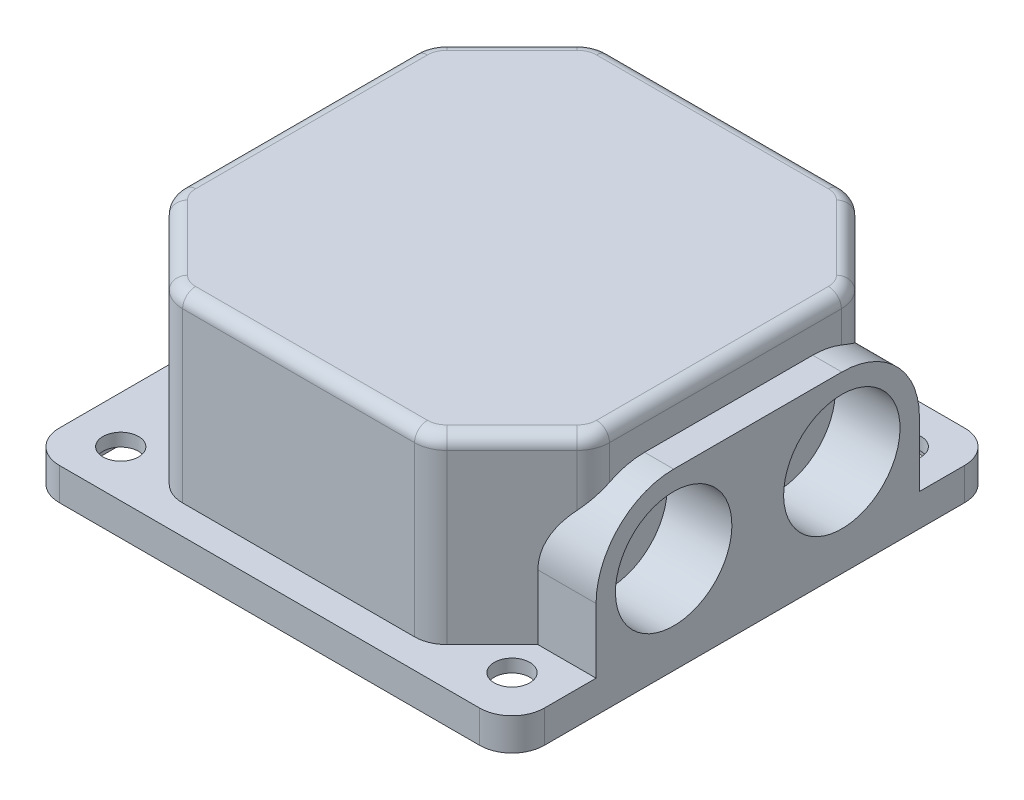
ISO-10303-21;
HEADER;
FILE_DESCRIPTION(('STEP AP214'),'2;1');
FILE_NAME('part.step','',(''),(''),'','','');
FILE_SCHEMA(('AUTOMOTIVE_DESIGN { 1 0 10303 214 1 1 1 1 }'));
ENDSEC;
DATA;
#1=APPLICATION_CONTEXT('core data for automotive mechanical design processes');
#2=APPLICATION_PROTOCOL_DEFINITION('international standard','automotive_design',2000,#1);
#3=PRODUCT_CONTEXT('',#1,'mechanical');
#4=PRODUCT('Part','Part','',(#3));
#5=PRODUCT_RELATED_PRODUCT_CATEGORY('part','',(#4));
#6=PRODUCT_DEFINITION_FORMATION('','',#4);
#7=PRODUCT_DEFINITION_CONTEXT('part definition',#1,'design');
#8=PRODUCT_DEFINITION('design','',#6,#7);
#9=PRODUCT_DEFINITION_SHAPE('','',#8);
#10=(LENGTH_UNIT() NAMED_UNIT(*) SI_UNIT(.MILLI.,.METRE.));
#11=(NAMED_UNIT(*) PLANE_ANGLE_UNIT() SI_UNIT($,.RADIAN.));
#12=(NAMED_UNIT(*) SI_UNIT($,.STERADIAN.) SOLID_ANGLE_UNIT());
#13=UNCERTAINTY_MEASURE_WITH_UNIT(LENGTH_MEASURE(1.E-05),#10,'distance_accuracy_value','');
#14=(GEOMETRIC_REPRESENTATION_CONTEXT(3) GLOBAL_UNCERTAINTY_ASSIGNED_CONTEXT((#13)) GLOBAL_UNIT_ASSIGNED_CONTEXT((#10,
#11,#12)) REPRESENTATION_CONTEXT('',''));
#15=CARTESIAN_POINT('',(0.,0.,0.));
#16=DIRECTION('',(0.,0.,1.));
#17=DIRECTION('',(1.,0.,0.));
#18=AXIS2_PLACEMENT_3D('',#15,#16,#17);
#19=CARTESIAN_POINT('',(31.,100.,-80.9289321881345));
#20=DIRECTION('',(0.,0.,-1.));
#21=DIRECTION('',(-1.,0.,0.));
#22=AXIS2_PLACEMENT_3D('',#19,#20,#21);
#23=CYLINDRICAL_SURFACE('',#22,2.);
#24=CARTESIAN_POINT('',(31.,100.,-80.9289321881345));
#25=DIRECTION('',(0.,0.,1.));
#26=DIRECTION('',(1.,0.,0.));
#27=AXIS2_PLACEMENT_3D('',#24,#25,#26);
#28=CIRCLE('',#27,2.);
#29=CARTESIAN_POINT('',(31.,102.,-80.9289321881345));
#30=VERTEX_POINT('',#29);
#31=CARTESIAN_POINT('',(33.,100.,-80.9289321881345));
#32=VERTEX_POINT('',#31);
#33=EDGE_CURVE('E989',#30,#32,#28,.F.);
#34=ORIENTED_EDGE('',*,*,#33,.F.);
#35=DIRECTION('',(0.,0.,1.));
#36=VECTOR('',#35,1.);
#37=CARTESIAN_POINT('',(31.,102.,-80.9289321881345));
#38=LINE('',#37,#36);
#39=CARTESIAN_POINT('',(31.,102.,-45.0710678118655));
#40=VERTEX_POINT('',#39);
#41=EDGE_CURVE('E1315',#30,#40,#38,.T.);
#42=ORIENTED_EDGE('',*,*,#41,.T.);
#43=CARTESIAN_POINT('',(31.,100.,-45.0710678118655));
#44=DIRECTION('',(0.,0.,1.));
#45=DIRECTION('',(1.,0.,0.));
#46=AXIS2_PLACEMENT_3D('',#43,#44,#45);
#47=CIRCLE('',#46,2.);
#48=CARTESIAN_POINT('',(33.,100.,-45.0710678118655));
#49=VERTEX_POINT('',#48);
#50=EDGE_CURVE('E1311',#49,#40,#47,.T.);
#51=ORIENTED_EDGE('',*,*,#50,.F.);
#52=DIRECTION('',(0.,0.,1.));
#53=VECTOR('',#52,1.);
#54=CARTESIAN_POINT('',(33.,100.,-80.9289321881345));
#55=LINE('',#54,#53);
#56=EDGE_CURVE('E984',#49,#32,#55,.F.);
#57=ORIENTED_EDGE('',*,*,#56,.T.);
#58=EDGE_LOOP('',(#34,#42,#51,#57));
#59=FACE_BOUND('',#58,.T.);
#60=ADVANCED_FACE('F16',(#59),#23,.T.);
#61=CARTESIAN_POINT('',(28.,100.,-45.0710678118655));
#62=DIRECTION('',(0.,-1.,0.));
#63=DIRECTION('',(1.,0.,0.));
#64=AXIS2_PLACEMENT_3D('',#61,#62,#63);
#65=TOROIDAL_SURFACE('',#64,3.,2.);
#66=ORIENTED_EDGE('',*,*,#50,.T.);
#67=CARTESIAN_POINT('',(28.,102.,-45.0710678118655));
#68=DIRECTION('',(0.,-1.,0.));
#69=DIRECTION('',(1.,0.,0.));
#70=AXIS2_PLACEMENT_3D('',#67,#68,#69);
#71=CIRCLE('',#70,3.);
#72=CARTESIAN_POINT('',(30.1213203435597,102.,-42.9497474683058));
#73=VERTEX_POINT('',#72);
#74=EDGE_CURVE('E1307',#40,#73,#71,.T.);
#75=ORIENTED_EDGE('',*,*,#74,.T.);
#76=CARTESIAN_POINT('',(30.1213203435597,100.,-42.9497474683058));
#77=DIRECTION('',(0.707106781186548,0.,-0.707106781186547));
#78=DIRECTION('',(-0.707106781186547,0.,-0.707106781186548));
#79=AXIS2_PLACEMENT_3D('',#76,#77,#78);
#80=CIRCLE('',#79,2.);
#81=CARTESIAN_POINT('',(31.5355339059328,100.,-41.5355339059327));
#82=VERTEX_POINT('',#81);
#83=EDGE_CURVE('E980',#82,#73,#80,.F.);
#84=ORIENTED_EDGE('',*,*,#83,.F.);
#85=CARTESIAN_POINT('',(28.,100.,-45.0710678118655));
#86=DIRECTION('',(0.,-1.,0.));
#87=DIRECTION('',(1.,0.,0.));
#88=AXIS2_PLACEMENT_3D('',#85,#86,#87);
#89=CIRCLE('',#88,5.00000000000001);
#90=EDGE_CURVE('E967',#49,#82,#89,.T.);
#91=ORIENTED_EDGE('',*,*,#90,.F.);
#92=EDGE_LOOP('',(#66,#75,#84,#91));
#93=FACE_BOUND('',#92,.T.);
#94=ADVANCED_FACE('F1309',(#93),#65,.T.);
#95=CARTESIAN_POINT('',(28.,102.,-80.9289321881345));
#96=DIRECTION('',(0.,-1.,0.));
#97=DIRECTION('',(1.,0.,0.));
#98=AXIS2_PLACEMENT_3D('',#95,#96,#97);
#99=PLANE('',#98);
#100=ORIENTED_EDGE('',*,*,#41,.F.);
#101=CARTESIAN_POINT('',(28.,102.,-80.9289321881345));
#102=DIRECTION('',(0.,-1.,0.));
#103=DIRECTION('',(0.707106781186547,0.,-0.707106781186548));
#104=AXIS2_PLACEMENT_3D('',#101,#102,#103);
#105=CIRCLE('',#104,2.99999999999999);
#106=CARTESIAN_POINT('',(30.1213203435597,102.,-83.0502525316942));
#107=VERTEX_POINT('',#106);
#108=EDGE_CURVE('E992',#107,#30,#105,.T.);
#109=ORIENTED_EDGE('',*,*,#108,.F.);
#110=DIRECTION('',(-0.707106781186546,0.,-0.707106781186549));
#111=VECTOR('',#110,1.);
#112=CARTESIAN_POINT('',(30.1213203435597,102.,-83.0502525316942));
#113=LINE('',#112,#111);
#114=CARTESIAN_POINT('',(20.0502525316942,102.,-93.1213203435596));
#115=VERTEX_POINT('',#114);
#116=EDGE_CURVE('E838',#115,#107,#113,.F.);
#117=ORIENTED_EDGE('',*,*,#116,.F.);
#118=CARTESIAN_POINT('',(17.9289321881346,102.,-91.));
#119=DIRECTION('',(0.,-1.,0.));
#120=DIRECTION('',(0.,0.,-1.));
#121=AXIS2_PLACEMENT_3D('',#118,#119,#120);
#122=CIRCLE('',#121,3.);
#123=CARTESIAN_POINT('',(17.9289321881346,102.,-94.));
#124=VERTEX_POINT('',#123);
#125=EDGE_CURVE('E845',#124,#115,#122,.T.);
#126=ORIENTED_EDGE('',*,*,#125,.F.);
#127=DIRECTION('',(-1.,0.,0.));
#128=VECTOR('',#127,1.);
#129=CARTESIAN_POINT('',(28.,102.,-94.));
#130=LINE('',#129,#128);
#131=CARTESIAN_POINT('',(-17.9289321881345,102.,-94.));
#132=VERTEX_POINT('',#131);
#133=EDGE_CURVE('E852',#132,#124,#130,.F.);
#134=ORIENTED_EDGE('',*,*,#133,.F.);
#135=CARTESIAN_POINT('',(-17.9289321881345,102.,-91.));
#136=DIRECTION('',(0.,-1.,0.));
#137=DIRECTION('',(-0.707106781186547,0.,-0.707106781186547));
#138=AXIS2_PLACEMENT_3D('',#135,#136,#137);
#139=CIRCLE('',#138,3.00000000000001);
#140=CARTESIAN_POINT('',(-20.0502525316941,102.,-93.1213203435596));
#141=VERTEX_POINT('',#140);
#142=EDGE_CURVE('E868',#141,#132,#139,.T.);
#143=ORIENTED_EDGE('',*,*,#142,.F.);
#144=DIRECTION('',(-0.707106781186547,0.,0.707106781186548));
#145=VECTOR('',#144,1.);
#146=CARTESIAN_POINT('',(-2.12132034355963,102.,-111.050252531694));
#147=LINE('',#146,#145);
#148=CARTESIAN_POINT('',(-30.1213203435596,102.,-83.0502525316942));
#149=VERTEX_POINT('',#148);
#150=EDGE_CURVE('E875',#149,#141,#147,.F.);
#151=ORIENTED_EDGE('',*,*,#150,.F.);
#152=CARTESIAN_POINT('',(-28.,102.,-80.9289321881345));
#153=DIRECTION('',(0.,-1.,0.));
#154=DIRECTION('',(-1.,0.,0.));
#155=AXIS2_PLACEMENT_3D('',#152,#153,#154);
#156=CIRCLE('',#155,3.);
#157=CARTESIAN_POINT('',(-31.,102.,-80.9289321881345));
#158=VERTEX_POINT('',#157);
#159=EDGE_CURVE('E891',#158,#149,#156,.T.);
#160=ORIENTED_EDGE('',*,*,#159,.F.);
#161=DIRECTION('',(0.,0.,1.));
#162=VECTOR('',#161,1.);
#163=CARTESIAN_POINT('',(-31.,102.,-80.9289321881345));
#164=LINE('',#163,#162);
#165=CARTESIAN_POINT('',(-31.,102.,-45.0710678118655));
#166=VERTEX_POINT('',#165);
#167=EDGE_CURVE('E898',#166,#158,#164,.F.);
#168=ORIENTED_EDGE('',*,*,#167,.F.);
#169=CARTESIAN_POINT('',(-28.,102.,-45.0710678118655));
#170=DIRECTION('',(0.,-1.,0.));
#171=DIRECTION('',(-0.707106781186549,0.,0.707106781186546));
#172=AXIS2_PLACEMENT_3D('',#169,#170,#171);
#173=CIRCLE('',#172,3.00000000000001);
#174=CARTESIAN_POINT('',(-30.1213203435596,102.,-42.9497474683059));
#175=VERTEX_POINT('',#174);
#176=EDGE_CURVE('E914',#175,#166,#173,.T.);
#177=ORIENTED_EDGE('',*,*,#176,.F.);
#178=DIRECTION('',(0.707106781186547,0.,0.707106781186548));
#179=VECTOR('',#178,1.);
#180=CARTESIAN_POINT('',(-20.0502525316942,102.,-32.8786796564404));
#181=LINE('',#180,#179);
#182=CARTESIAN_POINT('',(-20.0502525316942,102.,-32.8786796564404));
#183=VERTEX_POINT('',#182);
#184=EDGE_CURVE('E921',#183,#175,#181,.F.);
#185=ORIENTED_EDGE('',*,*,#184,.F.);
#186=CARTESIAN_POINT('',(-17.9289321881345,102.,-35.));
#187=DIRECTION('',(0.,-1.,0.));
#188=DIRECTION('',(0.,0.,1.));
#189=AXIS2_PLACEMENT_3D('',#186,#187,#188);
#190=CIRCLE('',#189,3.);
#191=CARTESIAN_POINT('',(-17.9289321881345,102.,-32.));
#192=VERTEX_POINT('',#191);
#193=EDGE_CURVE('E937',#192,#183,#190,.T.);
#194=ORIENTED_EDGE('',*,*,#193,.F.);
#195=DIRECTION('',(1.,0.,0.));
#196=VECTOR('',#195,1.);
#197=CARTESIAN_POINT('',(28.,102.,-32.));
#198=LINE('',#197,#196);
#199=CARTESIAN_POINT('',(17.9289321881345,102.,-32.));
#200=VERTEX_POINT('',#199);
#201=EDGE_CURVE('E944',#200,#192,#198,.F.);
#202=ORIENTED_EDGE('',*,*,#201,.F.);
#203=CARTESIAN_POINT('',(17.9289321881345,102.,-35.));
#204=DIRECTION('',(0.,-1.,0.));
#205=DIRECTION('',(0.707106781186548,0.,0.707106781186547));
#206=AXIS2_PLACEMENT_3D('',#203,#204,#205);
#207=CIRCLE('',#206,3.);
#208=CARTESIAN_POINT('',(20.0502525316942,102.,-32.8786796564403));
#209=VERTEX_POINT('',#208);
#210=EDGE_CURVE('E960',#209,#200,#207,.T.);
#211=ORIENTED_EDGE('',*,*,#210,.F.);
#212=DIRECTION('',(0.707106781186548,0.,-0.707106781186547));
#213=VECTOR('',#212,1.);
#214=CARTESIAN_POINT('',(48.0502525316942,102.,-60.8786796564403));
#215=LINE('',#214,#213);
#216=EDGE_CURVE('E983',#73,#209,#215,.F.);
#217=ORIENTED_EDGE('',*,*,#216,.F.);
#218=ORIENTED_EDGE('',*,*,#74,.F.);
#219=EDGE_LOOP('',(#100,#109,#117,#126,#134,#143,#151,#160,#168,#177,#185,#194,#202,#211,#217,#218));
#220=FACE_BOUND('',#219,.T.);
#221=ADVANCED_FACE('F1283',(#220),#99,.F.);
#222=CARTESIAN_POINT('',(28.,100.,-80.9289321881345));
#223=DIRECTION('',(0.,-1.,0.));
#224=DIRECTION('',(1.,0.,0.));
#225=AXIS2_PLACEMENT_3D('',#222,#223,#224);
#226=TOROIDAL_SURFACE('',#225,3.,2.);
#227=ORIENTED_EDGE('',*,*,#33,.T.);
#228=CARTESIAN_POINT('',(28.,100.,-80.9289321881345));
#229=DIRECTION('',(0.,-1.,0.));
#230=DIRECTION('',(1.,0.,0.));
#231=AXIS2_PLACEMENT_3D('',#228,#229,#230);
#232=CIRCLE('',#231,5.00000000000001);
#233=CARTESIAN_POINT('',(31.5355339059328,100.,-84.4644660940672));
#234=VERTEX_POINT('',#233);
#235=EDGE_CURVE('E823',#234,#32,#232,.T.);
#236=ORIENTED_EDGE('',*,*,#235,.F.);
#237=CARTESIAN_POINT('',(30.1213203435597,100.,-83.0502525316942));
#238=DIRECTION('',(-0.707106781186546,0.,-0.707106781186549));
#239=DIRECTION('',(-0.707106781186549,0.,0.707106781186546));
#240=AXIS2_PLACEMENT_3D('',#237,#238,#239);
#241=CIRCLE('',#240,2.00000000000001);
#242=EDGE_CURVE('E835',#107,#234,#241,.T.);
#243=ORIENTED_EDGE('',*,*,#242,.F.);
#244=ORIENTED_EDGE('',*,*,#108,.T.);
#245=EDGE_LOOP('',(#227,#236,#243,#244));
#246=FACE_BOUND('',#245,.T.);
#247=ADVANCED_FACE('F1276',(#246),#226,.T.);
#248=CARTESIAN_POINT('',(27.5,84.,-76.5));
#249=DIRECTION('',(1.,0.,0.));
#250=DIRECTION('',(0.,1.,0.));
#251=AXIS2_PLACEMENT_3D('',#248,#249,#250);
#252=PLANE('',#251);
#253=CARTESIAN_POINT('',(27.5,84.,-76.5));
#254=DIRECTION('',(1.,0.,0.));
#255=DIRECTION('',(0.,1.,0.));
#256=AXIS2_PLACEMENT_3D('',#253,#254,#255);
#257=CIRCLE('',#256,9.00000000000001);
#258=CARTESIAN_POINT('',(27.5,93.,-76.5));
#259=VERTEX_POINT('',#258);
#260=EDGE_CURVE('E20',#259,#259,#257,.T.);
#261=ORIENTED_EDGE('',*,*,#260,.T.);
#262=EDGE_LOOP('',(#261));
#263=FACE_BOUND('',#262,.T.);
#264=ADVANCED_FACE('F1273',(#263),#252,.T.);
#265=CARTESIAN_POINT('',(27.5,84.,-50.5));
#266=DIRECTION('',(1.,0.,0.));
#267=DIRECTION('',(0.,1.,0.));
#268=AXIS2_PLACEMENT_3D('',#265,#266,#267);
#269=PLANE('',#268);
#270=CARTESIAN_POINT('',(27.5,84.,-50.5));
#271=DIRECTION('',(1.,0.,0.));
#272=DIRECTION('',(0.,1.,0.));
#273=AXIS2_PLACEMENT_3D('',#270,#271,#272);
#274=CIRCLE('',#273,9.);
#275=CARTESIAN_POINT('',(27.5,93.,-50.5));
#276=VERTEX_POINT('',#275);
#277=EDGE_CURVE('E344',#276,#276,#274,.T.);
#278=ORIENTED_EDGE('',*,*,#277,.T.);
#279=EDGE_LOOP('',(#278));
#280=FACE_BOUND('',#279,.T.);
#281=ADVANCED_FACE('F1275',(#280),#269,.T.);
#282=CARTESIAN_POINT('',(33.,102.,-80.9289321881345));
#283=DIRECTION('',(-1.,0.,0.));
#284=DIRECTION('',(0.,-1.,0.));
#285=AXIS2_PLACEMENT_3D('',#282,#283,#284);
#286=PLANE('',#285);
#287=CARTESIAN_POINT('',(33.,84.,-50.5));
#288=DIRECTION('',(1.,0.,0.));
#289=DIRECTION('',(0.,1.,0.));
#290=AXIS2_PLACEMENT_3D('',#287,#288,#289);
#291=CIRCLE('',#290,12.);
#292=CARTESIAN_POINT('',(33.,96.,-50.5));
#293=VERTEX_POINT('',#292);
#294=CARTESIAN_POINT('',(33.,94.701714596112,-45.0710678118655));
#295=VERTEX_POINT('',#294);
#296=EDGE_CURVE('E390',#293,#295,#291,.T.);
#297=ORIENTED_EDGE('',*,*,#296,.F.);
#298=DIRECTION('',(0.,0.,1.));
#299=VECTOR('',#298,1.);
#300=CARTESIAN_POINT('',(33.,96.,-76.5));
#301=LINE('',#300,#299);
#302=CARTESIAN_POINT('',(33.,96.,-76.5));
#303=VERTEX_POINT('',#302);
#304=EDGE_CURVE('E820',#303,#293,#301,.T.);
#305=ORIENTED_EDGE('',*,*,#304,.F.);
#306=CARTESIAN_POINT('',(33.,84.,-76.5));
#307=DIRECTION('',(1.,0.,0.));
#308=DIRECTION('',(0.,1.,0.));
#309=AXIS2_PLACEMENT_3D('',#306,#307,#308);
#310=CIRCLE('',#309,12.);
#311=CARTESIAN_POINT('',(33.,95.1527825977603,-80.9289321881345));
#312=VERTEX_POINT('',#311);
#313=EDGE_CURVE('E343',#312,#303,#310,.T.);
#314=ORIENTED_EDGE('',*,*,#313,.F.);
#315=DIRECTION('',(0.,-1.,0.));
#316=VECTOR('',#315,1.);
#317=CARTESIAN_POINT('',(33.,102.,-80.9289321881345));
#318=LINE('',#317,#316);
#319=EDGE_CURVE('E338',#32,#312,#318,.T.);
#320=ORIENTED_EDGE('',*,*,#319,.F.);
#321=ORIENTED_EDGE('',*,*,#56,.F.);
#322=DIRECTION('',(0.,-1.,0.));
#323=VECTOR('',#322,1.);
#324=CARTESIAN_POINT('',(33.,102.,-45.0710678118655));
#325=LINE('',#324,#323);
#326=EDGE_CURVE('E977',#295,#49,#325,.F.);
#327=ORIENTED_EDGE('',*,*,#326,.F.);
#328=EDGE_LOOP('',(#297,#305,#314,#320,#321,#327));
#329=FACE_BOUND('',#328,.T.);
#330=ADVANCED_FACE('F1281',(#329),#286,.F.);
#331=CARTESIAN_POINT('',(48.0502525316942,100.,-60.8786796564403));
#332=DIRECTION('',(0.707106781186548,0.,-0.707106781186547));
#333=DIRECTION('',(-0.707106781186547,0.,-0.707106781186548));
#334=AXIS2_PLACEMENT_3D('',#331,#332,#333);
#335=CYLINDRICAL_SURFACE('',#334,2.);
#336=ORIENTED_EDGE('',*,*,#83,.T.);
#337=ORIENTED_EDGE('',*,*,#216,.T.);
#338=CARTESIAN_POINT('',(20.0502525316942,100.,-32.8786796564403));
#339=DIRECTION('',(-0.707106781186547,0.,0.707106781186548));
#340=DIRECTION('',(0.707106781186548,0.,0.707106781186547));
#341=AXIS2_PLACEMENT_3D('',#338,#339,#340);
#342=CIRCLE('',#341,2.);
#343=CARTESIAN_POINT('',(21.4644660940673,100.,-31.4644660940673));
#344=VERTEX_POINT('',#343);
#345=EDGE_CURVE('E963',#344,#209,#342,.T.);
#346=ORIENTED_EDGE('',*,*,#345,.F.);
#347=DIRECTION('',(-0.707106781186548,0.,0.707106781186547));
#348=VECTOR('',#347,1.);
#349=CARTESIAN_POINT('',(31.5355339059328,100.,-41.5355339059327));
#350=LINE('',#349,#348);
#351=EDGE_CURVE('E811',#344,#82,#350,.F.);
#352=ORIENTED_EDGE('',*,*,#351,.T.);
#353=EDGE_LOOP('',(#336,#337,#346,#352));
#354=FACE_BOUND('',#353,.T.);
#355=ADVANCED_FACE('F1291',(#354),#335,.T.);
#356=CARTESIAN_POINT('',(28.,102.,-45.0710678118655));
#357=DIRECTION('',(0.,-1.,0.));
#358=DIRECTION('',(1.,0.,0.));
#359=AXIS2_PLACEMENT_3D('',#356,#357,#358);
#360=CYLINDRICAL_SURFACE('',#359,5.00000000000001);
#361=ORIENTED_EDGE('',*,*,#326,.T.);
#362=ORIENTED_EDGE('',*,*,#90,.T.);
#363=DIRECTION('',(0.,1.,0.));
#364=VECTOR('',#363,1.);
#365=CARTESIAN_POINT('',(31.5355339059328,102.,-41.5355339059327));
#366=LINE('',#365,#364);
#367=CARTESIAN_POINT('',(31.5355339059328,91.9773647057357,-41.5355339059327));
#368=VERTEX_POINT('',#367);
#369=EDGE_CURVE('E380',#82,#368,#366,.F.);
#370=ORIENTED_EDGE('',*,*,#369,.T.);
#371=CARTESIAN_POINT('',(33.,94.701714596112,-45.0710678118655));
#372=CARTESIAN_POINT('',(33.0000054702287,94.6203572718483,-44.9106161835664));
#373=CARTESIAN_POINT('',(32.992279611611,94.5353772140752,-44.7521159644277));
#374=CARTESIAN_POINT('',(32.9625170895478,94.3591261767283,-44.4402708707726));
#375=CARTESIAN_POINT('',(32.9404977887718,94.2678629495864,-44.2869199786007));
#376=CARTESIAN_POINT('',(32.8834302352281,94.0802441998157,-43.986944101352));
#377=CARTESIAN_POINT('',(32.8484442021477,93.9839148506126,-43.8402906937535));
#378=CARTESIAN_POINT('',(32.7664935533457,93.7865982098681,-43.5535778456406));
#379=CARTESIAN_POINT('',(32.7195254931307,93.6856095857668,-43.4135203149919));
#380=CARTESIAN_POINT('',(32.6148536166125,93.4803661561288,-43.1412252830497));
#381=CARTESIAN_POINT('',(32.5572069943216,93.3761311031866,-43.0089508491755));
#382=CARTESIAN_POINT('',(32.4318548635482,93.1647553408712,-42.7517732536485));
#383=CARTESIAN_POINT('',(32.3641492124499,93.057614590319,-42.6268701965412));
#384=CARTESIAN_POINT('',(32.1468989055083,92.7329129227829,-42.2634060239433));
#385=CARTESIAN_POINT('',(31.9831761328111,92.5119857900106,-42.0359761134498));
#386=CARTESIAN_POINT('',(31.7598592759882,92.2383170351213,-41.7744396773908));
#387=CARTESIAN_POINT('',(31.7162853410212,92.1860477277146,-41.725394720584));
#388=CARTESIAN_POINT('',(31.6273042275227,92.0816233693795,-41.6291277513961));
#389=CARTESIAN_POINT('',(31.5819003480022,92.0294682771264,-41.5819027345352));
#390=CARTESIAN_POINT('',(31.5355339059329,91.9773647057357,-41.5355339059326));
#391=B_SPLINE_CURVE_WITH_KNOTS('',3,(#371,#372,#373,#374,#375,#376,#377,#378,#379,#380,#381,
#382,#383,#384,#385,#386,#387,#388,#389,#390),.UNSPECIFIED.,.F.,.F.,(4,2,2,2,2,2,2,2,2,4),(0.,
0.539337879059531,1.07802183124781,1.61415373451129,2.15043993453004,2.68393276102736,
3.21743315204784,4.28398768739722,4.53562051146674,4.78681838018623),.UNSPECIFIED.);
#392=EDGE_CURVE('E381',#295,#368,#391,.T.);
#393=ORIENTED_EDGE('',*,*,#392,.F.);
#394=EDGE_LOOP('',(#361,#362,#370,#393));
#395=FACE_BOUND('',#394,.T.);
#396=ADVANCED_FACE('F392',(#395),#360,.T.);
#397=CARTESIAN_POINT('',(17.9289321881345,100.,-35.));
#398=DIRECTION('',(0.,-1.,0.));
#399=DIRECTION('',(1.,0.,0.));
#400=AXIS2_PLACEMENT_3D('',#397,#398,#399);
#401=TOROIDAL_SURFACE('',#400,3.,2.);
#402=ORIENTED_EDGE('',*,*,#345,.T.);
#403=ORIENTED_EDGE('',*,*,#210,.T.);
#404=CARTESIAN_POINT('',(17.9289321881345,100.,-32.));
#405=DIRECTION('',(1.,0.,0.));
#406=DIRECTION('',(0.,1.,0.));
#407=AXIS2_PLACEMENT_3D('',#404,#405,#406);
#408=CIRCLE('',#407,2.);
#409=CARTESIAN_POINT('',(17.9289321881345,100.,-30.));
#410=VERTEX_POINT('',#409);
#411=EDGE_CURVE('E956',#410,#200,#408,.F.);
#412=ORIENTED_EDGE('',*,*,#411,.F.);
#413=CARTESIAN_POINT('',(17.9289321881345,100.,-35.));
#414=DIRECTION('',(0.,-1.,0.));
#415=DIRECTION('',(1.,0.,0.));
#416=AXIS2_PLACEMENT_3D('',#413,#414,#415);
#417=CIRCLE('',#416,5.00000000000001);
#418=EDGE_CURVE('E806',#344,#410,#417,.T.);
#419=ORIENTED_EDGE('',*,*,#418,.F.);
#420=EDGE_LOOP('',(#402,#403,#412,#419));
#421=FACE_BOUND('',#420,.T.);
#422=ADVANCED_FACE('F1297',(#421),#401,.T.);
#423=CARTESIAN_POINT('',(28.,100.,-32.));
#424=DIRECTION('',(1.,0.,0.));
#425=DIRECTION('',(0.,1.,0.));
#426=AXIS2_PLACEMENT_3D('',#423,#424,#425);
#427=CYLINDRICAL_SURFACE('',#426,2.);
#428=ORIENTED_EDGE('',*,*,#411,.T.);
#429=ORIENTED_EDGE('',*,*,#201,.T.);
#430=CARTESIAN_POINT('',(-17.9289321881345,100.,-32.));
#431=DIRECTION('',(-1.,0.,0.));
#432=DIRECTION('',(0.,0.,1.));
#433=AXIS2_PLACEMENT_3D('',#430,#431,#432);
#434=CIRCLE('',#433,2.);
#435=CARTESIAN_POINT('',(-17.9289321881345,100.,-30.));
#436=VERTEX_POINT('',#435);
#437=EDGE_CURVE('E940',#436,#192,#434,.T.);
#438=ORIENTED_EDGE('',*,*,#437,.F.);
#439=DIRECTION('',(-1.,0.,0.));
#440=VECTOR('',#439,1.);
#441=CARTESIAN_POINT('',(17.9289321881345,100.,-30.));
#442=LINE('',#441,#440);
#443=EDGE_CURVE('E799',#436,#410,#442,.F.);
#444=ORIENTED_EDGE('',*,*,#443,.T.);
#445=EDGE_LOOP('',(#428,#429,#438,#444));
#446=FACE_BOUND('',#445,.T.);
#447=ADVANCED_FACE('F1558',(#446),#427,.T.);
#448=CARTESIAN_POINT('',(-17.9289321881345,100.,-35.));
#449=DIRECTION('',(0.,-1.,0.));
#450=DIRECTION('',(1.,0.,0.));
#451=AXIS2_PLACEMENT_3D('',#448,#449,#450);
#452=TOROIDAL_SURFACE('',#451,3.,2.);
#453=ORIENTED_EDGE('',*,*,#437,.T.);
#454=ORIENTED_EDGE('',*,*,#193,.T.);
#455=CARTESIAN_POINT('',(-20.0502525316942,100.,-32.8786796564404));
#456=DIRECTION('',(0.707106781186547,0.,0.707106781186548));
#457=DIRECTION('',(0.707106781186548,0.,-0.707106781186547));
#458=AXIS2_PLACEMENT_3D('',#455,#456,#457);
#459=CIRCLE('',#458,2.);
#460=CARTESIAN_POINT('',(-21.4644660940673,100.,-31.4644660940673));
#461=VERTEX_POINT('',#460);
#462=EDGE_CURVE('E933',#461,#183,#459,.F.);
#463=ORIENTED_EDGE('',*,*,#462,.F.);
#464=CARTESIAN_POINT('',(-17.9289321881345,100.,-35.));
#465=DIRECTION('',(0.,-1.,0.));
#466=DIRECTION('',(1.,0.,0.));
#467=AXIS2_PLACEMENT_3D('',#464,#465,#466);
#468=CIRCLE('',#467,5.);
#469=EDGE_CURVE('E792',#436,#461,#468,.T.);
#470=ORIENTED_EDGE('',*,*,#469,.F.);
#471=EDGE_LOOP('',(#453,#454,#463,#470));
#472=FACE_BOUND('',#471,.T.);
#473=ADVANCED_FACE('F1541',(#472),#452,.T.);
#474=CARTESIAN_POINT('',(-20.0502525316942,100.,-32.8786796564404));
#475=DIRECTION('',(0.707106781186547,0.,0.707106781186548));
#476=DIRECTION('',(0.707106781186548,0.,-0.707106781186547));
#477=AXIS2_PLACEMENT_3D('',#474,#475,#476);
#478=CYLINDRICAL_SURFACE('',#477,2.);
#479=ORIENTED_EDGE('',*,*,#462,.T.);
#480=ORIENTED_EDGE('',*,*,#184,.T.);
#481=CARTESIAN_POINT('',(-30.1213203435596,100.,-42.9497474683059));
#482=DIRECTION('',(-0.707106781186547,0.,-0.707106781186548));
#483=DIRECTION('',(-0.707106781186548,0.,0.707106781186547));
#484=AXIS2_PLACEMENT_3D('',#481,#482,#483);
#485=CIRCLE('',#484,2.);
#486=CARTESIAN_POINT('',(-31.5355339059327,100.,-41.5355339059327));
#487=VERTEX_POINT('',#486);
#488=EDGE_CURVE('E917',#487,#175,#485,.T.);
#489=ORIENTED_EDGE('',*,*,#488,.F.);
#490=DIRECTION('',(-0.707106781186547,0.,-0.707106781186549));
#491=VECTOR('',#490,1.);
#492=CARTESIAN_POINT('',(-21.4644660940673,100.,-31.4644660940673));
#493=LINE('',#492,#491);
#494=EDGE_CURVE('E785',#487,#461,#493,.F.);
#495=ORIENTED_EDGE('',*,*,#494,.T.);
#496=EDGE_LOOP('',(#479,#480,#489,#495));
#497=FACE_BOUND('',#496,.T.);
#498=ADVANCED_FACE('F1392',(#497),#478,.T.);
#499=CARTESIAN_POINT('',(-28.,100.,-45.0710678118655));
#500=DIRECTION('',(0.,-1.,0.));
#501=DIRECTION('',(1.,0.,0.));
#502=AXIS2_PLACEMENT_3D('',#499,#500,#501);
#503=TOROIDAL_SURFACE('',#502,3.,2.);
#504=ORIENTED_EDGE('',*,*,#488,.T.);
#505=ORIENTED_EDGE('',*,*,#176,.T.);
#506=CARTESIAN_POINT('',(-31.,100.,-45.0710678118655));
#507=DIRECTION('',(0.,0.,1.));
#508=DIRECTION('',(1.,0.,0.));
#509=AXIS2_PLACEMENT_3D('',#506,#507,#508);
#510=CIRCLE('',#509,2.);
#511=CARTESIAN_POINT('',(-33.,100.,-45.0710678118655));
#512=VERTEX_POINT('',#511);
#513=EDGE_CURVE('E910',#512,#166,#510,.F.);
#514=ORIENTED_EDGE('',*,*,#513,.F.);
#515=CARTESIAN_POINT('',(-28.,100.,-45.0710678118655));
#516=DIRECTION('',(0.,-1.,0.));
#517=DIRECTION('',(1.,0.,0.));
#518=AXIS2_PLACEMENT_3D('',#515,#516,#517);
#519=CIRCLE('',#518,5.);
#520=EDGE_CURVE('E778',#487,#512,#519,.T.);
#521=ORIENTED_EDGE('',*,*,#520,.F.);
#522=EDGE_LOOP('',(#504,#505,#514,#521));
#523=FACE_BOUND('',#522,.T.);
#524=ADVANCED_FACE('F1380',(#523),#503,.T.);
#525=CARTESIAN_POINT('',(-31.,100.,-80.9289321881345));
#526=DIRECTION('',(0.,0.,1.));
#527=DIRECTION('',(1.,0.,0.));
#528=AXIS2_PLACEMENT_3D('',#525,#526,#527);
#529=CYLINDRICAL_SURFACE('',#528,2.);
#530=ORIENTED_EDGE('',*,*,#513,.T.);
#531=ORIENTED_EDGE('',*,*,#167,.T.);
#532=CARTESIAN_POINT('',(-31.,100.,-80.9289321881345));
#533=DIRECTION('',(0.,0.,-1.));
#534=DIRECTION('',(-1.,0.,0.));
#535=AXIS2_PLACEMENT_3D('',#532,#533,#534);
#536=CIRCLE('',#535,2.);
#537=CARTESIAN_POINT('',(-33.,100.,-80.9289321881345));
#538=VERTEX_POINT('',#537);
#539=EDGE_CURVE('E894',#538,#158,#536,.T.);
#540=ORIENTED_EDGE('',*,*,#539,.F.);
#541=DIRECTION('',(0.,0.,1.));
#542=VECTOR('',#541,1.);
#543=CARTESIAN_POINT('',(-33.,100.,-45.0710678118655));
#544=LINE('',#543,#542);
#545=EDGE_CURVE('E771',#538,#512,#544,.T.);
#546=ORIENTED_EDGE('',*,*,#545,.T.);
#547=EDGE_LOOP('',(#530,#531,#540,#546));
#548=FACE_BOUND('',#547,.T.);
#549=ADVANCED_FACE('F1391',(#548),#529,.T.);
#550=CARTESIAN_POINT('',(-28.,100.,-80.9289321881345));
#551=DIRECTION('',(0.,-1.,0.));
#552=DIRECTION('',(1.,0.,0.));
#553=AXIS2_PLACEMENT_3D('',#550,#551,#552);
#554=TOROIDAL_SURFACE('',#553,3.,2.);
#555=CARTESIAN_POINT('',(-30.1213203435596,100.,-83.0502525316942));
#556=DIRECTION('',(-0.707106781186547,0.,0.707106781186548));
#557=DIRECTION('',(0.707106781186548,0.,0.707106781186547));
#558=AXIS2_PLACEMENT_3D('',#555,#556,#557);
#559=CIRCLE('',#558,2.);
#560=CARTESIAN_POINT('',(-31.5355339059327,100.,-84.4644660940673));
#561=VERTEX_POINT('',#560);
#562=EDGE_CURVE('E887',#561,#149,#559,.F.);
#563=ORIENTED_EDGE('',*,*,#562,.F.);
#564=CARTESIAN_POINT('',(-28.,100.,-80.9289321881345));
#565=DIRECTION('',(0.,-1.,0.));
#566=DIRECTION('',(1.,0.,0.));
#567=AXIS2_PLACEMENT_3D('',#564,#565,#566);
#568=CIRCLE('',#567,5.);
#569=EDGE_CURVE('E764',#538,#561,#568,.T.);
#570=ORIENTED_EDGE('',*,*,#569,.F.);
#571=ORIENTED_EDGE('',*,*,#539,.T.);
#572=ORIENTED_EDGE('',*,*,#159,.T.);
#573=EDGE_LOOP('',(#563,#570,#571,#572));
#574=FACE_BOUND('',#573,.T.);
#575=ADVANCED_FACE('F1399',(#574),#554,.T.);
#576=CARTESIAN_POINT('',(-2.12132034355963,100.,-111.050252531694));
#577=DIRECTION('',(-0.707106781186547,0.,0.707106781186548));
#578=DIRECTION('',(0.707106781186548,0.,0.707106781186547));
#579=AXIS2_PLACEMENT_3D('',#576,#577,#578);
#580=CYLINDRICAL_SURFACE('',#579,2.);
#581=CARTESIAN_POINT('',(-20.0502525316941,100.,-93.1213203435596));
#582=DIRECTION('',(0.707106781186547,0.,-0.707106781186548));
#583=DIRECTION('',(-0.707106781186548,0.,-0.707106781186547));
#584=AXIS2_PLACEMENT_3D('',#581,#582,#583);
#585=CIRCLE('',#584,2.);
#586=CARTESIAN_POINT('',(-21.4644660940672,100.,-94.5355339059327));
#587=VERTEX_POINT('',#586);
#588=EDGE_CURVE('E871',#587,#141,#585,.T.);
#589=ORIENTED_EDGE('',*,*,#588,.F.);
#590=DIRECTION('',(0.707106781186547,0.,-0.707106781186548));
#591=VECTOR('',#590,1.);
#592=CARTESIAN_POINT('',(-31.5355339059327,100.,-84.4644660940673));
#593=LINE('',#592,#591);
#594=EDGE_CURVE('E757',#587,#561,#593,.F.);
#595=ORIENTED_EDGE('',*,*,#594,.T.);
#596=ORIENTED_EDGE('',*,*,#562,.T.);
#597=ORIENTED_EDGE('',*,*,#150,.T.);
#598=EDGE_LOOP('',(#589,#595,#596,#597));
#599=FACE_BOUND('',#598,.T.);
#600=ADVANCED_FACE('F1403',(#599),#580,.T.);
#601=CARTESIAN_POINT('',(-17.9289321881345,100.,-91.));
#602=DIRECTION('',(0.,-1.,0.));
#603=DIRECTION('',(1.,0.,0.));
#604=AXIS2_PLACEMENT_3D('',#601,#602,#603);
#605=TOROIDAL_SURFACE('',#604,3.,2.);
#606=CARTESIAN_POINT('',(-17.9289321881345,100.,-94.));
#607=DIRECTION('',(-1.,0.,0.));
#608=DIRECTION('',(0.,-1.,0.));
#609=AXIS2_PLACEMENT_3D('',#606,#607,#608);
#610=CIRCLE('',#609,2.);
#611=CARTESIAN_POINT('',(-17.9289321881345,100.,-96.));
#612=VERTEX_POINT('',#611);
#613=EDGE_CURVE('E864',#612,#132,#610,.F.);
#614=ORIENTED_EDGE('',*,*,#613,.F.);
#615=CARTESIAN_POINT('',(-17.9289321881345,100.,-91.));
#616=DIRECTION('',(0.,-1.,0.));
#617=DIRECTION('',(1.,0.,0.));
#618=AXIS2_PLACEMENT_3D('',#615,#616,#617);
#619=CIRCLE('',#618,5.);
#620=EDGE_CURVE('E750',#587,#612,#619,.T.);
#621=ORIENTED_EDGE('',*,*,#620,.F.);
#622=ORIENTED_EDGE('',*,*,#588,.T.);
#623=ORIENTED_EDGE('',*,*,#142,.T.);
#624=EDGE_LOOP('',(#614,#621,#622,#623));
#625=FACE_BOUND('',#624,.T.);
#626=ADVANCED_FACE('F1406',(#625),#605,.T.);
#627=CARTESIAN_POINT('',(28.,100.,-94.));
#628=DIRECTION('',(-1.,0.,0.));
#629=DIRECTION('',(0.,-1.,0.));
#630=AXIS2_PLACEMENT_3D('',#627,#628,#629);
#631=CYLINDRICAL_SURFACE('',#630,2.);
#632=CARTESIAN_POINT('',(17.9289321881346,100.,-94.));
#633=DIRECTION('',(1.,0.,0.));
#634=DIRECTION('',(0.,0.,-1.));
#635=AXIS2_PLACEMENT_3D('',#632,#633,#634);
#636=CIRCLE('',#635,2.);
#637=CARTESIAN_POINT('',(17.9289321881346,100.,-96.));
#638=VERTEX_POINT('',#637);
#639=EDGE_CURVE('E848',#638,#124,#636,.T.);
#640=ORIENTED_EDGE('',*,*,#639,.F.);
#641=DIRECTION('',(1.,0.,0.));
#642=VECTOR('',#641,1.);
#643=CARTESIAN_POINT('',(-17.9289321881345,100.,-96.));
#644=LINE('',#643,#642);
#645=EDGE_CURVE('E743',#638,#612,#644,.F.);
#646=ORIENTED_EDGE('',*,*,#645,.T.);
#647=ORIENTED_EDGE('',*,*,#613,.T.);
#648=ORIENTED_EDGE('',*,*,#133,.T.);
#649=EDGE_LOOP('',(#640,#646,#647,#648));
#650=FACE_BOUND('',#649,.T.);
#651=ADVANCED_FACE('F1025',(#650),#631,.T.);
#652=CARTESIAN_POINT('',(17.9289321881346,100.,-91.));
#653=DIRECTION('',(0.,-1.,0.));
#654=DIRECTION('',(1.,0.,0.));
#655=AXIS2_PLACEMENT_3D('',#652,#653,#654);
#656=TOROIDAL_SURFACE('',#655,3.,2.);
#657=CARTESIAN_POINT('',(20.0502525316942,100.,-93.1213203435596));
#658=DIRECTION('',(-0.707106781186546,0.,-0.707106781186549));
#659=DIRECTION('',(-0.707106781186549,0.,0.707106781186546));
#660=AXIS2_PLACEMENT_3D('',#657,#658,#659);
#661=CIRCLE('',#660,2.00000000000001);
#662=CARTESIAN_POINT('',(21.4644660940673,100.,-94.5355339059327));
#663=VERTEX_POINT('',#662);
#664=EDGE_CURVE('E841',#663,#115,#661,.F.);
#665=ORIENTED_EDGE('',*,*,#664,.F.);
#666=CARTESIAN_POINT('',(17.9289321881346,100.,-91.));
#667=DIRECTION('',(0.,-1.,0.));
#668=DIRECTION('',(1.,0.,0.));
#669=AXIS2_PLACEMENT_3D('',#666,#667,#668);
#670=CIRCLE('',#669,5.);
#671=EDGE_CURVE('E736',#638,#663,#670,.T.);
#672=ORIENTED_EDGE('',*,*,#671,.F.);
#673=ORIENTED_EDGE('',*,*,#639,.T.);
#674=ORIENTED_EDGE('',*,*,#125,.T.);
#675=EDGE_LOOP('',(#665,#672,#673,#674));
#676=FACE_BOUND('',#675,.T.);
#677=ADVANCED_FACE('F1013',(#676),#656,.T.);
#678=CARTESIAN_POINT('',(30.1213203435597,100.,-83.0502525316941));
#679=DIRECTION('',(-0.707106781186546,0.,-0.707106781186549));
#680=DIRECTION('',(-0.707106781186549,0.,0.707106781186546));
#681=AXIS2_PLACEMENT_3D('',#678,#679,#680);
#682=CYLINDRICAL_SURFACE('',#681,2.00000000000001);
#683=ORIENTED_EDGE('',*,*,#242,.T.);
#684=DIRECTION('',(0.707106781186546,0.,0.707106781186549));
#685=VECTOR('',#684,1.);
#686=CARTESIAN_POINT('',(21.4644660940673,100.,-94.5355339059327));
#687=LINE('',#686,#685);
#688=EDGE_CURVE('E354',#234,#663,#687,.F.);
#689=ORIENTED_EDGE('',*,*,#688,.T.);
#690=ORIENTED_EDGE('',*,*,#664,.T.);
#691=ORIENTED_EDGE('',*,*,#116,.T.);
#692=EDGE_LOOP('',(#683,#689,#690,#691));
#693=FACE_BOUND('',#692,.T.);
#694=ADVANCED_FACE('F1024',(#693),#682,.T.);
#695=CARTESIAN_POINT('',(28.,102.,-80.9289321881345));
#696=DIRECTION('',(0.,-1.,0.));
#697=DIRECTION('',(1.,0.,0.));
#698=AXIS2_PLACEMENT_3D('',#695,#696,#697);
#699=CYLINDRICAL_SURFACE('',#698,5.00000000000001);
#700=DIRECTION('',(0.,1.,0.));
#701=VECTOR('',#700,1.);
#702=CARTESIAN_POINT('',(31.5355339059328,102.,-84.4644660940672));
#703=LINE('',#702,#701);
#704=CARTESIAN_POINT('',(31.5355339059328,92.975927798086,-84.4644660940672));
#705=VERTEX_POINT('',#704);
#706=EDGE_CURVE('E336',#705,#234,#703,.T.);
#707=ORIENTED_EDGE('',*,*,#706,.T.);
#708=ORIENTED_EDGE('',*,*,#235,.T.);
#709=ORIENTED_EDGE('',*,*,#319,.T.);
#710=CARTESIAN_POINT('',(31.5355339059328,92.975927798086,-84.4644660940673));
#711=CARTESIAN_POINT('',(31.6004948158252,93.0335768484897,-84.3994975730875));
#712=CARTESIAN_POINT('',(31.6635604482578,93.0914439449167,-84.3328583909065));
#713=CARTESIAN_POINT('',(31.7858688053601,93.207343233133,-84.1962880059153));
#714=CARTESIAN_POINT('',(31.8451113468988,93.265375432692,-84.1263566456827));
#715=CARTESIAN_POINT('',(32.0171352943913,93.4393944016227,-83.9115972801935));
#716=CARTESIAN_POINT('',(32.1241125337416,93.5552136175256,-83.7619045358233));
#717=CARTESIAN_POINT('',(32.318193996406,93.7801927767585,-83.455764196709));
#718=CARTESIAN_POINT('',(32.4058669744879,93.8894434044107,-83.2997423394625));
#719=CARTESIAN_POINT('',(32.5648622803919,94.1037932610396,-82.9769472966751));
#720=CARTESIAN_POINT('',(32.6361930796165,94.2088946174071,-82.8101797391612));
#721=CARTESIAN_POINT('',(32.7462116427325,94.3889132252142,-82.5077980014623));
#722=CARTESIAN_POINT('',(32.7886269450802,94.465045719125,-82.3742526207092));
#723=CARTESIAN_POINT('',(32.8624833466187,94.613263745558,-82.1020216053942));
#724=CARTESIAN_POINT('',(32.8939284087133,94.6853507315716,-81.9633378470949));
#725=CARTESIAN_POINT('',(32.9458164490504,94.8267377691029,-81.6776237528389));
#726=CARTESIAN_POINT('',(32.965934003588,94.895907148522,-81.5304688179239));
#727=CARTESIAN_POINT('',(32.9930394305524,95.0286997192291,-81.2322979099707));
#728=CARTESIAN_POINT('',(33.0000120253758,95.0923163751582,-81.0812776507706));
#729=CARTESIAN_POINT('',(33.,95.1527825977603,-80.9289321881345));
#730=B_SPLINE_CURVE_WITH_KNOTS('',3,(#710,#711,#712,#713,#714,#715,#716,#717,#718,#719,#720,
#721,#722,#723,#724,#725,#726,#727,#728,#729),.UNSPECIFIED.,.F.,.F.,(4,2,2,2,2,2,2,2,2,4),(0.,
0.325323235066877,0.650662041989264,1.30184233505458,1.93000738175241,2.55784606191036,
3.03577974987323,3.51354060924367,4.00440559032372,4.49584072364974),.UNSPECIFIED.);
#731=EDGE_CURVE('E332',#705,#312,#730,.T.);
#732=ORIENTED_EDGE('',*,*,#731,.F.);
#733=EDGE_LOOP('',(#707,#708,#709,#732));
#734=FACE_BOUND('',#733,.T.);
#735=ADVANCED_FACE('F334',(#734),#699,.T.);
#736=CARTESIAN_POINT('',(27.5,84.,-76.5));
#737=DIRECTION('',(1.,0.,0.));
#738=DIRECTION('',(0.,1.,0.));
#739=AXIS2_PLACEMENT_3D('',#736,#737,#738);
#740=CYLINDRICAL_SURFACE('',#739,9.00000000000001);
#741=ORIENTED_EDGE('',*,*,#260,.F.);
#742=EDGE_LOOP('',(#741));
#743=FACE_BOUND('',#742,.T.);
#744=CARTESIAN_POINT('',(37.5,84.,-76.5));
#745=DIRECTION('',(1.,0.,0.));
#746=DIRECTION('',(0.,1.,0.));
#747=AXIS2_PLACEMENT_3D('',#744,#745,#746);
#748=CIRCLE('',#747,9.00000000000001);
#749=CARTESIAN_POINT('',(37.5000000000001,93.,-76.5));
#750=VERTEX_POINT('',#749);
#751=EDGE_CURVE('E374',#750,#750,#748,.F.);
#752=ORIENTED_EDGE('',*,*,#751,.F.);
#753=EDGE_LOOP('',(#752));
#754=FACE_BOUND('',#753,.T.);
#755=ADVANCED_FACE('F1248',(#743,#754),#740,.F.);
#756=CARTESIAN_POINT('',(27.5,84.,-50.5));
#757=DIRECTION('',(1.,0.,0.));
#758=DIRECTION('',(0.,1.,0.));
#759=AXIS2_PLACEMENT_3D('',#756,#757,#758);
#760=CYLINDRICAL_SURFACE('',#759,9.);
#761=CARTESIAN_POINT('',(37.5,84.,-50.5));
#762=DIRECTION('',(1.,0.,0.));
#763=DIRECTION('',(0.,1.,0.));
#764=AXIS2_PLACEMENT_3D('',#761,#762,#763);
#765=CIRCLE('',#764,9.);
#766=CARTESIAN_POINT('',(37.5,93.,-50.5));
#767=VERTEX_POINT('',#766);
#768=EDGE_CURVE('E1062',#767,#767,#765,.F.);
#769=ORIENTED_EDGE('',*,*,#768,.F.);
#770=EDGE_LOOP('',(#769));
#771=FACE_BOUND('',#770,.T.);
#772=ORIENTED_EDGE('',*,*,#277,.F.);
#773=EDGE_LOOP('',(#772));
#774=FACE_BOUND('',#773,.T.);
#775=ADVANCED_FACE('F1250',(#771,#774),#760,.F.);
#776=CARTESIAN_POINT('',(26.3505282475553,84.,-76.5));
#777=DIRECTION('',(1.,0.,0.));
#778=DIRECTION('',(0.,1.,0.));
#779=AXIS2_PLACEMENT_3D('',#776,#777,#778);
#780=CYLINDRICAL_SURFACE('',#779,12.);
#781=CARTESIAN_POINT('',(37.5,84.,-76.5));
#782=DIRECTION('',(1.,0.,0.));
#783=DIRECTION('',(0.,1.,0.));
#784=AXIS2_PLACEMENT_3D('',#781,#782,#783);
#785=CIRCLE('',#784,12.);
#786=CARTESIAN_POINT('',(37.5,84.,-88.5));
#787=VERTEX_POINT('',#786);
#788=CARTESIAN_POINT('',(37.5,96.,-76.5));
#789=VERTEX_POINT('',#788);
#790=EDGE_CURVE('E1057',#787,#789,#785,.T.);
#791=ORIENTED_EDGE('',*,*,#790,.F.);
#792=DIRECTION('',(-1.,0.,0.));
#793=VECTOR('',#792,1.);
#794=CARTESIAN_POINT('',(26.3505282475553,84.,-88.5));
#795=LINE('',#794,#793);
#796=CARTESIAN_POINT('',(27.5,84.,-88.5));
#797=VERTEX_POINT('',#796);
#798=EDGE_CURVE('E362',#797,#787,#795,.F.);
#799=ORIENTED_EDGE('',*,*,#798,.F.);
#800=CARTESIAN_POINT('',(39.5,84.,-76.5));
#801=DIRECTION('',(-0.707106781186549,0.,0.707106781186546));
#802=DIRECTION('',(0.707106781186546,0.,0.707106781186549));
#803=AXIS2_PLACEMENT_3D('',#800,#801,#802);
#804=ELLIPSE('',#803,16.9705627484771,12.);
#805=EDGE_CURVE('E350',#797,#705,#804,.F.);
#806=ORIENTED_EDGE('',*,*,#805,.T.);
#807=ORIENTED_EDGE('',*,*,#731,.T.);
#808=ORIENTED_EDGE('',*,*,#313,.T.);
#809=DIRECTION('',(1.,0.,0.));
#810=VECTOR('',#809,1.);
#811=CARTESIAN_POINT('',(26.3505282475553,96.,-76.5));
#812=LINE('',#811,#810);
#813=EDGE_CURVE('E816',#789,#303,#812,.F.);
#814=ORIENTED_EDGE('',*,*,#813,.F.);
#815=EDGE_LOOP('',(#791,#799,#806,#807,#808,#814));
#816=FACE_BOUND('',#815,.T.);
#817=ADVANCED_FACE('F361',(#816),#780,.T.);
#818=CARTESIAN_POINT('',(26.3505282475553,96.,-76.5));
#819=DIRECTION('',(0.,1.,0.));
#820=DIRECTION('',(0.,0.,1.));
#821=AXIS2_PLACEMENT_3D('',#818,#819,#820);
#822=PLANE('',#821);
#823=DIRECTION('',(0.,0.,1.));
#824=VECTOR('',#823,1.);
#825=CARTESIAN_POINT('',(37.5,96.,-30.5));
#826=LINE('',#825,#824);
#827=CARTESIAN_POINT('',(37.5,96.,-50.5));
#828=VERTEX_POINT('',#827);
#829=EDGE_CURVE('E1054',#789,#828,#826,.T.);
#830=ORIENTED_EDGE('',*,*,#829,.F.);
#831=ORIENTED_EDGE('',*,*,#813,.T.);
#832=ORIENTED_EDGE('',*,*,#304,.T.);
#833=DIRECTION('',(1.,0.,0.));
#834=VECTOR('',#833,1.);
#835=CARTESIAN_POINT('',(26.3505282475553,96.,-50.5));
#836=LINE('',#835,#834);
#837=EDGE_CURVE('E812',#828,#293,#836,.F.);
#838=ORIENTED_EDGE('',*,*,#837,.F.);
#839=EDGE_LOOP('',(#830,#831,#832,#838));
#840=FACE_BOUND('',#839,.T.);
#841=ADVANCED_FACE('F402',(#840),#822,.T.);
#842=CARTESIAN_POINT('',(26.3505282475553,84.,-50.5));
#843=DIRECTION('',(1.,0.,0.));
#844=DIRECTION('',(0.,1.,0.));
#845=AXIS2_PLACEMENT_3D('',#842,#843,#844);
#846=CYLINDRICAL_SURFACE('',#845,12.);
#847=ORIENTED_EDGE('',*,*,#296,.T.);
#848=ORIENTED_EDGE('',*,*,#392,.T.);
#849=CARTESIAN_POINT('',(40.5,84.,-50.5));
#850=DIRECTION('',(-0.707106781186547,0.,-0.707106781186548));
#851=DIRECTION('',(0.707106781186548,0.,-0.707106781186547));
#852=AXIS2_PLACEMENT_3D('',#849,#850,#851);
#853=ELLIPSE('',#852,16.9705627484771,12.);
#854=CARTESIAN_POINT('',(28.5,84.,-38.5));
#855=VERTEX_POINT('',#854);
#856=EDGE_CURVE('E376',#368,#855,#853,.F.);
#857=ORIENTED_EDGE('',*,*,#856,.T.);
#858=DIRECTION('',(1.,0.,0.));
#859=VECTOR('',#858,1.);
#860=CARTESIAN_POINT('',(26.3505282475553,84.,-38.5));
#861=LINE('',#860,#859);
#862=CARTESIAN_POINT('',(37.5,84.,-38.5));
#863=VERTEX_POINT('',#862);
#864=EDGE_CURVE('E389',#863,#855,#861,.F.);
#865=ORIENTED_EDGE('',*,*,#864,.F.);
#866=CARTESIAN_POINT('',(37.5,84.,-50.5));
#867=DIRECTION('',(1.,0.,0.));
#868=DIRECTION('',(0.,1.,0.));
#869=AXIS2_PLACEMENT_3D('',#866,#867,#868);
#870=CIRCLE('',#869,12.);
#871=EDGE_CURVE('E1051',#828,#863,#870,.T.);
#872=ORIENTED_EDGE('',*,*,#871,.F.);
#873=ORIENTED_EDGE('',*,*,#837,.T.);
#874=EDGE_LOOP('',(#847,#848,#857,#865,#872,#873));
#875=FACE_BOUND('',#874,.T.);
#876=ADVANCED_FACE('F396',(#875),#846,.T.);
#877=CARTESIAN_POINT('',(26.3505282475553,84.,-38.5));
#878=DIRECTION('',(0.,0.,1.));
#879=DIRECTION('',(0.,-1.,0.));
#880=AXIS2_PLACEMENT_3D('',#877,#878,#879);
#881=PLANE('',#880);
#882=DIRECTION('',(0.,1.,0.));
#883=VECTOR('',#882,1.);
#884=CARTESIAN_POINT('',(37.5,72.,-38.5));
#885=LINE('',#884,#883);
#886=CARTESIAN_POINT('',(37.5,74.,-38.5));
#887=VERTEX_POINT('',#886);
#888=EDGE_CURVE('E713',#863,#887,#885,.F.);
#889=ORIENTED_EDGE('',*,*,#888,.F.);
#890=ORIENTED_EDGE('',*,*,#864,.T.);
#891=DIRECTION('',(0.,1.,0.));
#892=VECTOR('',#891,1.);
#893=CARTESIAN_POINT('',(28.5,102.,-38.5));
#894=LINE('',#893,#892);
#895=CARTESIAN_POINT('',(28.5000000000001,74.,-38.5));
#896=VERTEX_POINT('',#895);
#897=EDGE_CURVE('E379',#855,#896,#894,.F.);
#898=ORIENTED_EDGE('',*,*,#897,.T.);
#899=DIRECTION('',(1.,0.,0.));
#900=VECTOR('',#899,1.);
#901=CARTESIAN_POINT('',(-32.5,74.,-38.5));
#902=LINE('',#901,#900);
#903=EDGE_CURVE('E691',#887,#896,#902,.F.);
#904=ORIENTED_EDGE('',*,*,#903,.F.);
#905=EDGE_LOOP('',(#889,#890,#898,#904));
#906=FACE_BOUND('',#905,.T.);
#907=ADVANCED_FACE('F401',(#906),#881,.T.);
#908=CARTESIAN_POINT('',(31.5355339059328,102.,-41.5355339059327));
#909=DIRECTION('',(-0.707106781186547,0.,-0.707106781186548));
#910=DIRECTION('',(-0.707106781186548,0.,0.707106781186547));
#911=AXIS2_PLACEMENT_3D('',#908,#909,#910);
#912=PLANE('',#911);
#913=ORIENTED_EDGE('',*,*,#897,.F.);
#914=ORIENTED_EDGE('',*,*,#856,.F.);
#915=ORIENTED_EDGE('',*,*,#369,.F.);
#916=ORIENTED_EDGE('',*,*,#351,.F.);
#917=DIRECTION('',(0.,-1.,0.));
#918=VECTOR('',#917,1.);
#919=CARTESIAN_POINT('',(21.4644660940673,102.,-31.4644660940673));
#920=LINE('',#919,#918);
#921=CARTESIAN_POINT('',(21.4644660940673,74.,-31.4644660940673));
#922=VERTEX_POINT('',#921);
#923=EDGE_CURVE('E802',#922,#344,#920,.F.);
#924=ORIENTED_EDGE('',*,*,#923,.F.);
#925=DIRECTION('',(-0.707106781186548,0.,0.707106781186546));
#926=VECTOR('',#925,1.);
#927=CARTESIAN_POINT('',(28.5,74.,-38.5));
#928=LINE('',#927,#926);
#929=EDGE_CURVE('E716',#896,#922,#928,.T.);
#930=ORIENTED_EDGE('',*,*,#929,.F.);
#931=EDGE_LOOP('',(#913,#914,#915,#916,#924,#930));
#932=FACE_BOUND('',#931,.T.);
#933=ADVANCED_FACE('F407',(#932),#912,.F.);
#934=CARTESIAN_POINT('',(17.9289321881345,102.,-35.));
#935=DIRECTION('',(0.,-1.,0.));
#936=DIRECTION('',(1.,0.,0.));
#937=AXIS2_PLACEMENT_3D('',#934,#935,#936);
#938=CYLINDRICAL_SURFACE('',#937,5.00000000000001);
#939=DIRECTION('',(0.,1.,0.));
#940=VECTOR('',#939,1.);
#941=CARTESIAN_POINT('',(17.9289321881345,102.,-30.));
#942=LINE('',#941,#940);
#943=CARTESIAN_POINT('',(17.9289321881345,74.,-30.));
#944=VERTEX_POINT('',#943);
#945=EDGE_CURVE('E793',#410,#944,#942,.F.);
#946=ORIENTED_EDGE('',*,*,#945,.T.);
#947=CARTESIAN_POINT('',(17.9289321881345,74.,-35.));
#948=DIRECTION('',(0.,-1.,0.));
#949=DIRECTION('',(1.,0.,0.));
#950=AXIS2_PLACEMENT_3D('',#947,#948,#949);
#951=CIRCLE('',#950,5.00000000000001);
#952=EDGE_CURVE('E1116',#922,#944,#951,.T.);
#953=ORIENTED_EDGE('',*,*,#952,.F.);
#954=ORIENTED_EDGE('',*,*,#923,.T.);
#955=ORIENTED_EDGE('',*,*,#418,.T.);
#956=EDGE_LOOP('',(#946,#953,#954,#955));
#957=FACE_BOUND('',#956,.T.);
#958=ADVANCED_FACE('F411',(#957),#938,.T.);
#959=CARTESIAN_POINT('',(17.9289321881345,102.,-30.));
#960=DIRECTION('',(0.,0.,-1.));
#961=DIRECTION('',(-1.,0.,0.));
#962=AXIS2_PLACEMENT_3D('',#959,#960,#961);
#963=PLANE('',#962);
#964=ORIENTED_EDGE('',*,*,#443,.F.);
#965=DIRECTION('',(0.,-1.,0.));
#966=VECTOR('',#965,1.);
#967=CARTESIAN_POINT('',(-17.9289321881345,102.,-30.));
#968=LINE('',#967,#966);
#969=CARTESIAN_POINT('',(-17.9289321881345,74.,-30.));
#970=VERTEX_POINT('',#969);
#971=EDGE_CURVE('E788',#970,#436,#968,.F.);
#972=ORIENTED_EDGE('',*,*,#971,.F.);
#973=DIRECTION('',(1.,0.,0.));
#974=VECTOR('',#973,1.);
#975=CARTESIAN_POINT('',(-32.5,74.,-30.));
#976=LINE('',#975,#974);
#977=EDGE_CURVE('E1113',#944,#970,#976,.F.);
#978=ORIENTED_EDGE('',*,*,#977,.F.);
#979=ORIENTED_EDGE('',*,*,#945,.F.);
#980=EDGE_LOOP('',(#964,#972,#978,#979));
#981=FACE_BOUND('',#980,.T.);
#982=ADVANCED_FACE('F415',(#981),#963,.F.);
#983=CARTESIAN_POINT('',(-17.9289321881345,102.,-35.));
#984=DIRECTION('',(0.,-1.,0.));
#985=DIRECTION('',(1.,0.,0.));
#986=AXIS2_PLACEMENT_3D('',#983,#984,#985);
#987=CYLINDRICAL_SURFACE('',#986,5.);
#988=DIRECTION('',(0.,1.,0.));
#989=VECTOR('',#988,1.);
#990=CARTESIAN_POINT('',(-21.4644660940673,102.,-31.4644660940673));
#991=LINE('',#990,#989);
#992=CARTESIAN_POINT('',(-21.4644660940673,74.,-31.4644660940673));
#993=VERTEX_POINT('',#992);
#994=EDGE_CURVE('E779',#461,#993,#991,.F.);
#995=ORIENTED_EDGE('',*,*,#994,.T.);
#996=CARTESIAN_POINT('',(-17.9289321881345,74.,-35.));
#997=DIRECTION('',(0.,-1.,0.));
#998=DIRECTION('',(1.,0.,0.));
#999=AXIS2_PLACEMENT_3D('',#996,#997,#998);
#1000=CIRCLE('',#999,5.);
#1001=EDGE_CURVE('E1112',#970,#993,#1000,.T.);
#1002=ORIENTED_EDGE('',*,*,#1001,.F.);
#1003=ORIENTED_EDGE('',*,*,#971,.T.);
#1004=ORIENTED_EDGE('',*,*,#469,.T.);
#1005=EDGE_LOOP('',(#995,#1002,#1003,#1004));
#1006=FACE_BOUND('',#1005,.T.);
#1007=ADVANCED_FACE('F419',(#1006),#987,.T.);
#1008=CARTESIAN_POINT('',(-21.4644660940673,102.,-31.4644660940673));
#1009=DIRECTION('',(0.707106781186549,0.,-0.707106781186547));
#1010=DIRECTION('',(-0.707106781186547,0.,-0.707106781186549));
#1011=AXIS2_PLACEMENT_3D('',#1008,#1009,#1010);
#1012=PLANE('',#1011);
#1013=ORIENTED_EDGE('',*,*,#494,.F.);
#1014=DIRECTION('',(0.,-1.,0.));
#1015=VECTOR('',#1014,1.);
#1016=CARTESIAN_POINT('',(-31.5355339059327,102.,-41.5355339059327));
#1017=LINE('',#1016,#1015);
#1018=CARTESIAN_POINT('',(-31.5355339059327,74.,-41.5355339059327));
#1019=VERTEX_POINT('',#1018);
#1020=EDGE_CURVE('E774',#1019,#487,#1017,.F.);
#1021=ORIENTED_EDGE('',*,*,#1020,.F.);
#1022=DIRECTION('',(-0.707106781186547,0.,-0.707106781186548));
#1023=VECTOR('',#1022,1.);
#1024=CARTESIAN_POINT('',(-21.4644660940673,74.,-31.4644660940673));
#1025=LINE('',#1024,#1023);
#1026=EDGE_CURVE('E1109',#993,#1019,#1025,.T.);
#1027=ORIENTED_EDGE('',*,*,#1026,.F.);
#1028=ORIENTED_EDGE('',*,*,#994,.F.);
#1029=EDGE_LOOP('',(#1013,#1021,#1027,#1028));
#1030=FACE_BOUND('',#1029,.T.);
#1031=ADVANCED_FACE('F423',(#1030),#1012,.F.);
#1032=CARTESIAN_POINT('',(-28.,102.,-45.0710678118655));
#1033=DIRECTION('',(0.,-1.,0.));
#1034=DIRECTION('',(1.,0.,0.));
#1035=AXIS2_PLACEMENT_3D('',#1032,#1033,#1034);
#1036=CYLINDRICAL_SURFACE('',#1035,5.);
#1037=DIRECTION('',(0.,1.,0.));
#1038=VECTOR('',#1037,1.);
#1039=CARTESIAN_POINT('',(-33.,102.,-45.0710678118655));
#1040=LINE('',#1039,#1038);
#1041=CARTESIAN_POINT('',(-33.,74.,-45.0710678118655));
#1042=VERTEX_POINT('',#1041);
#1043=EDGE_CURVE('E765',#512,#1042,#1040,.F.);
#1044=ORIENTED_EDGE('',*,*,#1043,.T.);
#1045=CARTESIAN_POINT('',(-28.,74.,-45.0710678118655));
#1046=DIRECTION('',(0.,-1.,0.));
#1047=DIRECTION('',(1.,0.,0.));
#1048=AXIS2_PLACEMENT_3D('',#1045,#1046,#1047);
#1049=CIRCLE('',#1048,5.);
#1050=EDGE_CURVE('E1108',#1019,#1042,#1049,.T.);
#1051=ORIENTED_EDGE('',*,*,#1050,.F.);
#1052=ORIENTED_EDGE('',*,*,#1020,.T.);
#1053=ORIENTED_EDGE('',*,*,#520,.T.);
#1054=EDGE_LOOP('',(#1044,#1051,#1052,#1053));
#1055=FACE_BOUND('',#1054,.T.);
#1056=ADVANCED_FACE('F427',(#1055),#1036,.T.);
#1057=CARTESIAN_POINT('',(-33.,102.,-45.0710678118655));
#1058=DIRECTION('',(1.,0.,0.));
#1059=DIRECTION('',(0.,1.,0.));
#1060=AXIS2_PLACEMENT_3D('',#1057,#1058,#1059);
#1061=PLANE('',#1060);
#1062=ORIENTED_EDGE('',*,*,#545,.F.);
#1063=DIRECTION('',(0.,-1.,0.));
#1064=VECTOR('',#1063,1.);
#1065=CARTESIAN_POINT('',(-33.,102.,-80.9289321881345));
#1066=LINE('',#1065,#1064);
#1067=CARTESIAN_POINT('',(-33.,74.,-80.9289321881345));
#1068=VERTEX_POINT('',#1067);
#1069=EDGE_CURVE('E760',#1068,#538,#1066,.F.);
#1070=ORIENTED_EDGE('',*,*,#1069,.F.);
#1071=DIRECTION('',(0.,0.,1.));
#1072=VECTOR('',#1071,1.);
#1073=CARTESIAN_POINT('',(-33.,74.,-30.5));
#1074=LINE('',#1073,#1072);
#1075=EDGE_CURVE('E1105',#1042,#1068,#1074,.F.);
#1076=ORIENTED_EDGE('',*,*,#1075,.F.);
#1077=ORIENTED_EDGE('',*,*,#1043,.F.);
#1078=EDGE_LOOP('',(#1062,#1070,#1076,#1077));
#1079=FACE_BOUND('',#1078,.T.);
#1080=ADVANCED_FACE('F431',(#1079),#1061,.F.);
#1081=CARTESIAN_POINT('',(-28.,102.,-80.9289321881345));
#1082=DIRECTION('',(0.,-1.,0.));
#1083=DIRECTION('',(1.,0.,0.));
#1084=AXIS2_PLACEMENT_3D('',#1081,#1082,#1083);
#1085=CYLINDRICAL_SURFACE('',#1084,5.);
#1086=DIRECTION('',(0.,1.,0.));
#1087=VECTOR('',#1086,1.);
#1088=CARTESIAN_POINT('',(-31.5355339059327,102.,-84.4644660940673));
#1089=LINE('',#1088,#1087);
#1090=CARTESIAN_POINT('',(-31.5355339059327,74.,-84.4644660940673));
#1091=VERTEX_POINT('',#1090);
#1092=EDGE_CURVE('E751',#561,#1091,#1089,.F.);
#1093=ORIENTED_EDGE('',*,*,#1092,.T.);
#1094=CARTESIAN_POINT('',(-28.,74.,-80.9289321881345));
#1095=DIRECTION('',(0.,-1.,0.));
#1096=DIRECTION('',(1.,0.,0.));
#1097=AXIS2_PLACEMENT_3D('',#1094,#1095,#1096);
#1098=CIRCLE('',#1097,5.);
#1099=EDGE_CURVE('E1104',#1068,#1091,#1098,.T.);
#1100=ORIENTED_EDGE('',*,*,#1099,.F.);
#1101=ORIENTED_EDGE('',*,*,#1069,.T.);
#1102=ORIENTED_EDGE('',*,*,#569,.T.);
#1103=EDGE_LOOP('',(#1093,#1100,#1101,#1102));
#1104=FACE_BOUND('',#1103,.T.);
#1105=ADVANCED_FACE('F435',(#1104),#1085,.T.);
#1106=CARTESIAN_POINT('',(-31.5355339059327,102.,-84.4644660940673));
#1107=DIRECTION('',(0.707106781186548,0.,0.707106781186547));
#1108=DIRECTION('',(0.707106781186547,0.,-0.707106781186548));
#1109=AXIS2_PLACEMENT_3D('',#1106,#1107,#1108);
#1110=PLANE('',#1109);
#1111=ORIENTED_EDGE('',*,*,#594,.F.);
#1112=DIRECTION('',(0.,-1.,0.));
#1113=VECTOR('',#1112,1.);
#1114=CARTESIAN_POINT('',(-21.4644660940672,102.,-94.5355339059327));
#1115=LINE('',#1114,#1113);
#1116=CARTESIAN_POINT('',(-21.4644660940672,74.,-94.5355339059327));
#1117=VERTEX_POINT('',#1116);
#1118=EDGE_CURVE('E746',#1117,#587,#1115,.F.);
#1119=ORIENTED_EDGE('',*,*,#1118,.F.);
#1120=DIRECTION('',(0.707106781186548,0.,-0.707106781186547));
#1121=VECTOR('',#1120,1.);
#1122=CARTESIAN_POINT('',(-31.5355339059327,74.,-84.4644660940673));
#1123=LINE('',#1122,#1121);
#1124=EDGE_CURVE('E1101',#1091,#1117,#1123,.T.);
#1125=ORIENTED_EDGE('',*,*,#1124,.F.);
#1126=ORIENTED_EDGE('',*,*,#1092,.F.);
#1127=EDGE_LOOP('',(#1111,#1119,#1125,#1126));
#1128=FACE_BOUND('',#1127,.T.);
#1129=ADVANCED_FACE('F439',(#1128),#1110,.F.);
#1130=CARTESIAN_POINT('',(-17.9289321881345,102.,-91.));
#1131=DIRECTION('',(0.,-1.,0.));
#1132=DIRECTION('',(1.,0.,0.));
#1133=AXIS2_PLACEMENT_3D('',#1130,#1131,#1132);
#1134=CYLINDRICAL_SURFACE('',#1133,5.);
#1135=DIRECTION('',(0.,-1.,0.));
#1136=VECTOR('',#1135,1.);
#1137=CARTESIAN_POINT('',(-17.9289321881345,102.,-96.));
#1138=LINE('',#1137,#1136);
#1139=CARTESIAN_POINT('',(-17.9289321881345,74.,-96.));
#1140=VERTEX_POINT('',#1139);
#1141=EDGE_CURVE('E737',#612,#1140,#1138,.T.);
#1142=ORIENTED_EDGE('',*,*,#1141,.T.);
#1143=CARTESIAN_POINT('',(-17.9289321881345,74.,-91.));
#1144=DIRECTION('',(0.,-1.,0.));
#1145=DIRECTION('',(1.,0.,0.));
#1146=AXIS2_PLACEMENT_3D('',#1143,#1144,#1145);
#1147=CIRCLE('',#1146,5.);
#1148=EDGE_CURVE('E1100',#1117,#1140,#1147,.T.);
#1149=ORIENTED_EDGE('',*,*,#1148,.F.);
#1150=ORIENTED_EDGE('',*,*,#1118,.T.);
#1151=ORIENTED_EDGE('',*,*,#620,.T.);
#1152=EDGE_LOOP('',(#1142,#1149,#1150,#1151));
#1153=FACE_BOUND('',#1152,.T.);
#1154=ADVANCED_FACE('F443',(#1153),#1134,.T.);
#1155=CARTESIAN_POINT('',(-17.9289321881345,102.,-96.));
#1156=DIRECTION('',(0.,0.,1.));
#1157=DIRECTION('',(0.,-1.,0.));
#1158=AXIS2_PLACEMENT_3D('',#1155,#1156,#1157);
#1159=PLANE('',#1158);
#1160=ORIENTED_EDGE('',*,*,#645,.F.);
#1161=DIRECTION('',(0.,-1.,0.));
#1162=VECTOR('',#1161,1.);
#1163=CARTESIAN_POINT('',(17.9289321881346,102.,-96.));
#1164=LINE('',#1163,#1162);
#1165=CARTESIAN_POINT('',(17.9289321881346,74.,-96.));
#1166=VERTEX_POINT('',#1165);
#1167=EDGE_CURVE('E732',#1166,#638,#1164,.F.);
#1168=ORIENTED_EDGE('',*,*,#1167,.F.);
#1169=DIRECTION('',(1.,0.,0.));
#1170=VECTOR('',#1169,1.);
#1171=CARTESIAN_POINT('',(-32.5,74.,-96.));
#1172=LINE('',#1171,#1170);
#1173=EDGE_CURVE('E1097',#1140,#1166,#1172,.T.);
#1174=ORIENTED_EDGE('',*,*,#1173,.F.);
#1175=ORIENTED_EDGE('',*,*,#1141,.F.);
#1176=EDGE_LOOP('',(#1160,#1168,#1174,#1175));
#1177=FACE_BOUND('',#1176,.T.);
#1178=ADVANCED_FACE('F447',(#1177),#1159,.F.);
#1179=CARTESIAN_POINT('',(17.9289321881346,102.,-91.));
#1180=DIRECTION('',(0.,-1.,0.));
#1181=DIRECTION('',(1.,0.,0.));
#1182=AXIS2_PLACEMENT_3D('',#1179,#1180,#1181);
#1183=CYLINDRICAL_SURFACE('',#1182,5.);
#1184=DIRECTION('',(0.,1.,0.));
#1185=VECTOR('',#1184,1.);
#1186=CARTESIAN_POINT('',(21.4644660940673,102.,-94.5355339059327));
#1187=LINE('',#1186,#1185);
#1188=CARTESIAN_POINT('',(21.4644660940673,74.,-94.5355339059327));
#1189=VERTEX_POINT('',#1188);
#1190=EDGE_CURVE('E364',#663,#1189,#1187,.F.);
#1191=ORIENTED_EDGE('',*,*,#1190,.T.);
#1192=CARTESIAN_POINT('',(17.9289321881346,74.,-91.));
#1193=DIRECTION('',(0.,-1.,0.));
#1194=DIRECTION('',(1.,0.,0.));
#1195=AXIS2_PLACEMENT_3D('',#1192,#1193,#1194);
#1196=CIRCLE('',#1195,5.);
#1197=EDGE_CURVE('E1094',#1166,#1189,#1196,.T.);
#1198=ORIENTED_EDGE('',*,*,#1197,.F.);
#1199=ORIENTED_EDGE('',*,*,#1167,.T.);
#1200=ORIENTED_EDGE('',*,*,#671,.T.);
#1201=EDGE_LOOP('',(#1191,#1198,#1199,#1200));
#1202=FACE_BOUND('',#1201,.T.);
#1203=ADVANCED_FACE('F451',(#1202),#1183,.T.);
#1204=CARTESIAN_POINT('',(21.4644660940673,102.,-94.5355339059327));
#1205=DIRECTION('',(-0.707106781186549,0.,0.707106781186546));
#1206=DIRECTION('',(0.707106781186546,0.,0.707106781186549));
#1207=AXIS2_PLACEMENT_3D('',#1204,#1205,#1206);
#1208=PLANE('',#1207);
#1209=ORIENTED_EDGE('',*,*,#805,.F.);
#1210=DIRECTION('',(0.,1.,0.));
#1211=VECTOR('',#1210,1.);
#1212=CARTESIAN_POINT('',(27.5,69.,-88.5));
#1213=LINE('',#1212,#1211);
#1214=CARTESIAN_POINT('',(27.5,74.,-88.5));
#1215=VERTEX_POINT('',#1214);
#1216=EDGE_CURVE('E357',#1215,#797,#1213,.T.);
#1217=ORIENTED_EDGE('',*,*,#1216,.F.);
#1218=DIRECTION('',(0.707106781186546,0.,0.707106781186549));
#1219=VECTOR('',#1218,1.);
#1220=CARTESIAN_POINT('',(21.4644660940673,74.,-94.5355339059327));
#1221=LINE('',#1220,#1219);
#1222=EDGE_CURVE('E723',#1189,#1215,#1221,.T.);
#1223=ORIENTED_EDGE('',*,*,#1222,.F.);
#1224=ORIENTED_EDGE('',*,*,#1190,.F.);
#1225=ORIENTED_EDGE('',*,*,#688,.F.);
#1226=ORIENTED_EDGE('',*,*,#706,.F.);
#1227=EDGE_LOOP('',(#1209,#1217,#1223,#1224,#1225,#1226));
#1228=FACE_BOUND('',#1227,.T.);
#1229=ADVANCED_FACE('F348',(#1228),#1208,.F.);
#1230=CARTESIAN_POINT('',(26.3505282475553,69.,-88.5));
#1231=DIRECTION('',(0.,0.,-1.));
#1232=DIRECTION('',(-1.,0.,0.));
#1233=AXIS2_PLACEMENT_3D('',#1230,#1231,#1232);
#1234=PLANE('',#1233);
#1235=ORIENTED_EDGE('',*,*,#1216,.T.);
#1236=ORIENTED_EDGE('',*,*,#798,.T.);
#1237=DIRECTION('',(0.,1.,0.));
#1238=VECTOR('',#1237,1.);
#1239=CARTESIAN_POINT('',(37.5,72.,-88.5));
#1240=LINE('',#1239,#1238);
#1241=CARTESIAN_POINT('',(37.5,74.,-88.5));
#1242=VERTEX_POINT('',#1241);
#1243=EDGE_CURVE('E1058',#1242,#787,#1240,.T.);
#1244=ORIENTED_EDGE('',*,*,#1243,.F.);
#1245=DIRECTION('',(1.,0.,0.));
#1246=VECTOR('',#1245,1.);
#1247=CARTESIAN_POINT('',(-32.5,74.,-88.5));
#1248=LINE('',#1247,#1246);
#1249=EDGE_CURVE('E719',#1215,#1242,#1248,.T.);
#1250=ORIENTED_EDGE('',*,*,#1249,.F.);
#1251=EDGE_LOOP('',(#1235,#1236,#1244,#1250));
#1252=FACE_BOUND('',#1251,.T.);
#1253=ADVANCED_FACE('F458',(#1252),#1234,.T.);
#1254=CARTESIAN_POINT('',(37.5,72.,-30.5));
#1255=DIRECTION('',(1.,0.,0.));
#1256=DIRECTION('',(0.,1.,0.));
#1257=AXIS2_PLACEMENT_3D('',#1254,#1255,#1256);
#1258=PLANE('',#1257);
#1259=DIRECTION('',(0.,0.,1.));
#1260=VECTOR('',#1259,1.);
#1261=CARTESIAN_POINT('',(37.5,69.,-30.5));
#1262=LINE('',#1261,#1260);
#1263=CARTESIAN_POINT('',(37.5,69.,-95.5));
#1264=VERTEX_POINT('',#1263);
#1265=CARTESIAN_POINT('',(37.5,69.,-30.5));
#1266=VERTEX_POINT('',#1265);
#1267=EDGE_CURVE('E1069',#1264,#1266,#1262,.T.);
#1268=ORIENTED_EDGE('',*,*,#1267,.F.);
#1269=DIRECTION('',(0.,-1.,0.));
#1270=VECTOR('',#1269,1.);
#1271=CARTESIAN_POINT('',(37.5,72.,-95.5));
#1272=LINE('',#1271,#1270);
#1273=CARTESIAN_POINT('',(37.5,74.,-95.5));
#1274=VERTEX_POINT('',#1273);
#1275=EDGE_CURVE('E688',#1274,#1264,#1272,.T.);
#1276=ORIENTED_EDGE('',*,*,#1275,.F.);
#1277=DIRECTION('',(0.,0.,1.));
#1278=VECTOR('',#1277,1.);
#1279=CARTESIAN_POINT('',(37.5,74.,-30.5));
#1280=LINE('',#1279,#1278);
#1281=EDGE_CURVE('E722',#1242,#1274,#1280,.F.);
#1282=ORIENTED_EDGE('',*,*,#1281,.F.);
#1283=ORIENTED_EDGE('',*,*,#1243,.T.);
#1284=ORIENTED_EDGE('',*,*,#790,.T.);
#1285=ORIENTED_EDGE('',*,*,#829,.T.);
#1286=ORIENTED_EDGE('',*,*,#871,.T.);
#1287=ORIENTED_EDGE('',*,*,#888,.T.);
#1288=DIRECTION('',(0.,0.,1.));
#1289=VECTOR('',#1288,1.);
#1290=CARTESIAN_POINT('',(37.5,74.,-30.5));
#1291=LINE('',#1290,#1289);
#1292=CARTESIAN_POINT('',(37.5,74.,-30.5));
#1293=VERTEX_POINT('',#1292);
#1294=EDGE_CURVE('E1065',#1293,#887,#1291,.F.);
#1295=ORIENTED_EDGE('',*,*,#1294,.F.);
#1296=DIRECTION('',(0.,-1.,0.));
#1297=VECTOR('',#1296,1.);
#1298=CARTESIAN_POINT('',(37.5,72.,-30.5));
#1299=LINE('',#1298,#1297);
#1300=EDGE_CURVE('E710',#1266,#1293,#1299,.F.);
#1301=ORIENTED_EDGE('',*,*,#1300,.F.);
#1302=EDGE_LOOP('',(#1268,#1276,#1282,#1283,#1284,#1285,#1286,#1287,#1295,#1301));
#1303=FACE_BOUND('',#1302,.T.);
#1304=ORIENTED_EDGE('',*,*,#768,.T.);
#1305=EDGE_LOOP('',(#1304));
#1306=FACE_BOUND('',#1305,.T.);
#1307=ORIENTED_EDGE('',*,*,#751,.T.);
#1308=EDGE_LOOP('',(#1307));
#1309=FACE_BOUND('',#1308,.T.);
#1310=ADVANCED_FACE('F461',(#1303,#1306,#1309),#1258,.T.);
#1311=CARTESIAN_POINT('',(32.5,72.,-30.5));
#1312=DIRECTION('',(0.,-1.,0.));
#1313=DIRECTION('',(1.,0.,0.));
#1314=AXIS2_PLACEMENT_3D('',#1311,#1312,#1313);
#1315=CYLINDRICAL_SURFACE('',#1314,5.00000000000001);
#1316=CARTESIAN_POINT('',(32.5,74.,-30.5));
#1317=DIRECTION('',(0.,-1.,0.));
#1318=DIRECTION('',(1.,0.,0.));
#1319=AXIS2_PLACEMENT_3D('',#1316,#1317,#1318);
#1320=CIRCLE('',#1319,5.00000000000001);
#1321=CARTESIAN_POINT('',(32.5,74.,-25.5));
#1322=VERTEX_POINT('',#1321);
#1323=EDGE_CURVE('E1070',#1322,#1293,#1320,.F.);
#1324=ORIENTED_EDGE('',*,*,#1323,.F.);
#1325=DIRECTION('',(0.,-1.,0.));
#1326=VECTOR('',#1325,1.);
#1327=CARTESIAN_POINT('',(32.5,72.0000000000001,-25.5));
#1328=LINE('',#1327,#1326);
#1329=CARTESIAN_POINT('',(32.5,69.,-25.5));
#1330=VERTEX_POINT('',#1329);
#1331=EDGE_CURVE('E707',#1330,#1322,#1328,.F.);
#1332=ORIENTED_EDGE('',*,*,#1331,.F.);
#1333=CARTESIAN_POINT('',(32.5,69.,-30.5));
#1334=DIRECTION('',(0.,-1.,0.));
#1335=DIRECTION('',(1.,0.,0.));
#1336=AXIS2_PLACEMENT_3D('',#1333,#1334,#1335);
#1337=CIRCLE('',#1336,5.00000000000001);
#1338=EDGE_CURVE('E1133',#1266,#1330,#1337,.T.);
#1339=ORIENTED_EDGE('',*,*,#1338,.F.);
#1340=ORIENTED_EDGE('',*,*,#1300,.T.);
#1341=EDGE_LOOP('',(#1324,#1332,#1339,#1340));
#1342=FACE_BOUND('',#1341,.T.);
#1343=ADVANCED_FACE('F465',(#1342),#1315,.T.);
#1344=CARTESIAN_POINT('',(-32.5,72.0000000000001,-25.5));
#1345=DIRECTION('',(0.,0.,1.));
#1346=DIRECTION('',(0.,-1.,0.));
#1347=AXIS2_PLACEMENT_3D('',#1344,#1345,#1346);
#1348=PLANE('',#1347);
#1349=DIRECTION('',(1.,0.,0.));
#1350=VECTOR('',#1349,1.);
#1351=CARTESIAN_POINT('',(-32.5,74.,-25.5));
#1352=LINE('',#1351,#1350);
#1353=CARTESIAN_POINT('',(-32.5,74.,-25.5));
#1354=VERTEX_POINT('',#1353);
#1355=EDGE_CURVE('E1073',#1354,#1322,#1352,.T.);
#1356=ORIENTED_EDGE('',*,*,#1355,.F.);
#1357=DIRECTION('',(0.,-1.,0.));
#1358=VECTOR('',#1357,1.);
#1359=CARTESIAN_POINT('',(-32.5,72.0000000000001,-25.5));
#1360=LINE('',#1359,#1358);
#1361=CARTESIAN_POINT('',(-32.5,69.,-25.5));
#1362=VERTEX_POINT('',#1361);
#1363=EDGE_CURVE('E704',#1362,#1354,#1360,.F.);
#1364=ORIENTED_EDGE('',*,*,#1363,.F.);
#1365=DIRECTION('',(1.,0.,0.));
#1366=VECTOR('',#1365,1.);
#1367=CARTESIAN_POINT('',(-32.5,69.,-25.5));
#1368=LINE('',#1367,#1366);
#1369=EDGE_CURVE('E1130',#1330,#1362,#1368,.F.);
#1370=ORIENTED_EDGE('',*,*,#1369,.F.);
#1371=ORIENTED_EDGE('',*,*,#1331,.T.);
#1372=EDGE_LOOP('',(#1356,#1364,#1370,#1371));
#1373=FACE_BOUND('',#1372,.T.);
#1374=ADVANCED_FACE('F469',(#1373),#1348,.T.);
#1375=CARTESIAN_POINT('',(-32.5,72.0000000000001,-30.5));
#1376=DIRECTION('',(0.,-1.,0.));
#1377=DIRECTION('',(1.,0.,0.));
#1378=AXIS2_PLACEMENT_3D('',#1375,#1376,#1377);
#1379=CYLINDRICAL_SURFACE('',#1378,5.);
#1380=CARTESIAN_POINT('',(-32.5,74.,-30.5));
#1381=DIRECTION('',(0.,-1.,0.));
#1382=DIRECTION('',(1.,0.,0.));
#1383=AXIS2_PLACEMENT_3D('',#1380,#1381,#1382);
#1384=CIRCLE('',#1383,5.);
#1385=CARTESIAN_POINT('',(-37.5,74.,-30.5));
#1386=VERTEX_POINT('',#1385);
#1387=EDGE_CURVE('E1077',#1386,#1354,#1384,.F.);
#1388=ORIENTED_EDGE('',*,*,#1387,.F.);
#1389=DIRECTION('',(0.,-1.,0.));
#1390=VECTOR('',#1389,1.);
#1391=CARTESIAN_POINT('',(-37.5,72.0000000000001,-30.5));
#1392=LINE('',#1391,#1390);
#1393=CARTESIAN_POINT('',(-37.5,69.,-30.5));
#1394=VERTEX_POINT('',#1393);
#1395=EDGE_CURVE('E701',#1394,#1386,#1392,.F.);
#1396=ORIENTED_EDGE('',*,*,#1395,.F.);
#1397=CARTESIAN_POINT('',(-32.5,69.,-30.5));
#1398=DIRECTION('',(0.,-1.,0.));
#1399=DIRECTION('',(1.,0.,0.));
#1400=AXIS2_PLACEMENT_3D('',#1397,#1398,#1399);
#1401=CIRCLE('',#1400,5.);
#1402=EDGE_CURVE('E1129',#1362,#1394,#1401,.T.);
#1403=ORIENTED_EDGE('',*,*,#1402,.F.);
#1404=ORIENTED_EDGE('',*,*,#1363,.T.);
#1405=EDGE_LOOP('',(#1388,#1396,#1403,#1404));
#1406=FACE_BOUND('',#1405,.T.);
#1407=ADVANCED_FACE('F473',(#1406),#1379,.T.);
#1408=CARTESIAN_POINT('',(-37.5,72.0000000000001,-95.5));
#1409=DIRECTION('',(-1.,0.,0.));
#1410=DIRECTION('',(0.,-1.,0.));
#1411=AXIS2_PLACEMENT_3D('',#1408,#1409,#1410);
#1412=PLANE('',#1411);
#1413=DIRECTION('',(0.,0.,1.));
#1414=VECTOR('',#1413,1.);
#1415=CARTESIAN_POINT('',(-37.5,74.,-30.5));
#1416=LINE('',#1415,#1414);
#1417=CARTESIAN_POINT('',(-37.5,74.,-95.5));
#1418=VERTEX_POINT('',#1417);
#1419=EDGE_CURVE('E1078',#1418,#1386,#1416,.T.);
#1420=ORIENTED_EDGE('',*,*,#1419,.F.);
#1421=DIRECTION('',(0.,-1.,0.));
#1422=VECTOR('',#1421,1.);
#1423=CARTESIAN_POINT('',(-37.5,72.0000000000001,-95.5));
#1424=LINE('',#1423,#1422);
#1425=CARTESIAN_POINT('',(-37.5,69.,-95.5));
#1426=VERTEX_POINT('',#1425);
#1427=EDGE_CURVE('E698',#1426,#1418,#1424,.F.);
#1428=ORIENTED_EDGE('',*,*,#1427,.F.);
#1429=DIRECTION('',(0.,0.,1.));
#1430=VECTOR('',#1429,1.);
#1431=CARTESIAN_POINT('',(-37.5,69.,-30.5));
#1432=LINE('',#1431,#1430);
#1433=EDGE_CURVE('E1126',#1394,#1426,#1432,.F.);
#1434=ORIENTED_EDGE('',*,*,#1433,.F.);
#1435=ORIENTED_EDGE('',*,*,#1395,.T.);
#1436=EDGE_LOOP('',(#1420,#1428,#1434,#1435));
#1437=FACE_BOUND('',#1436,.T.);
#1438=ADVANCED_FACE('F477',(#1437),#1412,.T.);
#1439=CARTESIAN_POINT('',(-32.5,72.0000000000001,-95.5));
#1440=DIRECTION('',(0.,-1.,0.));
#1441=DIRECTION('',(1.,0.,0.));
#1442=AXIS2_PLACEMENT_3D('',#1439,#1440,#1441);
#1443=CYLINDRICAL_SURFACE('',#1442,5.);
#1444=CARTESIAN_POINT('',(-32.5,74.,-95.5));
#1445=DIRECTION('',(0.,-1.,0.));
#1446=DIRECTION('',(1.,0.,0.));
#1447=AXIS2_PLACEMENT_3D('',#1444,#1445,#1446);
#1448=CIRCLE('',#1447,5.);
#1449=CARTESIAN_POINT('',(-32.5,74.,-100.5));
#1450=VERTEX_POINT('',#1449);
#1451=EDGE_CURVE('E1082',#1450,#1418,#1448,.F.);
#1452=ORIENTED_EDGE('',*,*,#1451,.F.);
#1453=DIRECTION('',(0.,1.,0.));
#1454=VECTOR('',#1453,1.);
#1455=CARTESIAN_POINT('',(-32.5,72.,-100.5));
#1456=LINE('',#1455,#1454);
#1457=CARTESIAN_POINT('',(-32.5,69.,-100.5));
#1458=VERTEX_POINT('',#1457);
#1459=EDGE_CURVE('E695',#1458,#1450,#1456,.T.);
#1460=ORIENTED_EDGE('',*,*,#1459,.F.);
#1461=CARTESIAN_POINT('',(-32.5,69.,-95.5));
#1462=DIRECTION('',(0.,-1.,0.));
#1463=DIRECTION('',(1.,0.,0.));
#1464=AXIS2_PLACEMENT_3D('',#1461,#1462,#1463);
#1465=CIRCLE('',#1464,5.);
#1466=EDGE_CURVE('E1125',#1426,#1458,#1465,.T.);
#1467=ORIENTED_EDGE('',*,*,#1466,.F.);
#1468=ORIENTED_EDGE('',*,*,#1427,.T.);
#1469=EDGE_LOOP('',(#1452,#1460,#1467,#1468));
#1470=FACE_BOUND('',#1469,.T.);
#1471=ADVANCED_FACE('F481',(#1470),#1443,.T.);
#1472=CARTESIAN_POINT('',(32.5,72.,-100.5));
#1473=DIRECTION('',(0.,0.,-1.));
#1474=DIRECTION('',(-1.,0.,0.));
#1475=AXIS2_PLACEMENT_3D('',#1472,#1473,#1474);
#1476=PLANE('',#1475);
#1477=DIRECTION('',(1.,0.,0.));
#1478=VECTOR('',#1477,1.);
#1479=CARTESIAN_POINT('',(-32.5,74.,-100.5));
#1480=LINE('',#1479,#1478);
#1481=CARTESIAN_POINT('',(32.5,74.,-100.5));
#1482=VERTEX_POINT('',#1481);
#1483=EDGE_CURVE('E1083',#1482,#1450,#1480,.F.);
#1484=ORIENTED_EDGE('',*,*,#1483,.F.);
#1485=DIRECTION('',(0.,-1.,0.));
#1486=VECTOR('',#1485,1.);
#1487=CARTESIAN_POINT('',(32.5,72.,-100.5));
#1488=LINE('',#1487,#1486);
#1489=CARTESIAN_POINT('',(32.5,69.,-100.5));
#1490=VERTEX_POINT('',#1489);
#1491=EDGE_CURVE('E692',#1490,#1482,#1488,.F.);
#1492=ORIENTED_EDGE('',*,*,#1491,.F.);
#1493=DIRECTION('',(1.,0.,0.));
#1494=VECTOR('',#1493,1.);
#1495=CARTESIAN_POINT('',(-32.5,69.,-100.5));
#1496=LINE('',#1495,#1494);
#1497=EDGE_CURVE('E1121',#1458,#1490,#1496,.T.);
#1498=ORIENTED_EDGE('',*,*,#1497,.F.);
#1499=ORIENTED_EDGE('',*,*,#1459,.T.);
#1500=EDGE_LOOP('',(#1484,#1492,#1498,#1499));
#1501=FACE_BOUND('',#1500,.T.);
#1502=ADVANCED_FACE('F485',(#1501),#1476,.T.);
#1503=CARTESIAN_POINT('',(32.5,72.,-95.5));
#1504=DIRECTION('',(0.,-1.,0.));
#1505=DIRECTION('',(1.,0.,0.));
#1506=AXIS2_PLACEMENT_3D('',#1503,#1504,#1505);
#1507=CYLINDRICAL_SURFACE('',#1506,5.00000000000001);
#1508=CARTESIAN_POINT('',(32.5,74.,-95.5));
#1509=DIRECTION('',(0.,-1.,0.));
#1510=DIRECTION('',(1.,0.,0.));
#1511=AXIS2_PLACEMENT_3D('',#1508,#1509,#1510);
#1512=CIRCLE('',#1511,5.00000000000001);
#1513=EDGE_CURVE('E1087',#1274,#1482,#1512,.F.);
#1514=ORIENTED_EDGE('',*,*,#1513,.F.);
#1515=ORIENTED_EDGE('',*,*,#1275,.T.);
#1516=CARTESIAN_POINT('',(32.5,69.,-95.5));
#1517=DIRECTION('',(0.,-1.,0.));
#1518=DIRECTION('',(1.,0.,0.));
#1519=AXIS2_PLACEMENT_3D('',#1516,#1517,#1518);
#1520=CIRCLE('',#1519,5.00000000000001);
#1521=EDGE_CURVE('E1124',#1490,#1264,#1520,.T.);
#1522=ORIENTED_EDGE('',*,*,#1521,.F.);
#1523=ORIENTED_EDGE('',*,*,#1491,.T.);
#1524=EDGE_LOOP('',(#1514,#1515,#1522,#1523));
#1525=FACE_BOUND('',#1524,.T.);
#1526=ADVANCED_FACE('F489',(#1525),#1507,.T.);
#1527=CARTESIAN_POINT('',(-32.5,74.,-30.5));
#1528=DIRECTION('',(0.,1.,0.));
#1529=DIRECTION('',(0.,0.,1.));
#1530=AXIS2_PLACEMENT_3D('',#1527,#1528,#1529);
#1531=PLANE('',#1530);
#1532=CARTESIAN_POINT('',(-30.25,74.,-93.25));
#1533=DIRECTION('',(0.,-1.,0.));
#1534=DIRECTION('',(1.,0.,0.));
#1535=AXIS2_PLACEMENT_3D('',#1532,#1533,#1534);
#1536=CIRCLE('',#1535,2.75);
#1537=CARTESIAN_POINT('',(-27.5,74.,-93.25));
#1538=VERTEX_POINT('',#1537);
#1539=EDGE_CURVE('E658',#1538,#1538,#1536,.T.);
#1540=ORIENTED_EDGE('',*,*,#1539,.T.);
#1541=EDGE_LOOP('',(#1540));
#1542=FACE_BOUND('',#1541,.T.);
#1543=CARTESIAN_POINT('',(30.25,74.,-32.75));
#1544=DIRECTION('',(0.,-1.,0.));
#1545=DIRECTION('',(1.,0.,0.));
#1546=AXIS2_PLACEMENT_3D('',#1543,#1544,#1545);
#1547=CIRCLE('',#1546,2.75);
#1548=CARTESIAN_POINT('',(33.,74.,-32.75));
#1549=VERTEX_POINT('',#1548);
#1550=EDGE_CURVE('E1190',#1549,#1549,#1547,.T.);
#1551=ORIENTED_EDGE('',*,*,#1550,.T.);
#1552=EDGE_LOOP('',(#1551));
#1553=FACE_BOUND('',#1552,.T.);
#1554=CARTESIAN_POINT('',(-30.25,74.,-32.75));
#1555=DIRECTION('',(0.,-1.,0.));
#1556=DIRECTION('',(1.,0.,0.));
#1557=AXIS2_PLACEMENT_3D('',#1554,#1555,#1556);
#1558=CIRCLE('',#1557,2.75);
#1559=CARTESIAN_POINT('',(-27.5,74.,-32.75));
#1560=VERTEX_POINT('',#1559);
#1561=EDGE_CURVE('E1194',#1560,#1560,#1558,.T.);
#1562=ORIENTED_EDGE('',*,*,#1561,.T.);
#1563=EDGE_LOOP('',(#1562));
#1564=FACE_BOUND('',#1563,.T.);
#1565=CARTESIAN_POINT('',(30.25,74.,-93.25));
#1566=DIRECTION('',(0.,-1.,0.));
#1567=DIRECTION('',(1.,0.,0.));
#1568=AXIS2_PLACEMENT_3D('',#1565,#1566,#1567);
#1569=CIRCLE('',#1568,2.75);
#1570=CARTESIAN_POINT('',(33.,74.,-93.25));
#1571=VERTEX_POINT('',#1570);
#1572=EDGE_CURVE('E1198',#1571,#1571,#1569,.T.);
#1573=ORIENTED_EDGE('',*,*,#1572,.T.);
#1574=EDGE_LOOP('',(#1573));
#1575=FACE_BOUND('',#1574,.T.);
#1576=ORIENTED_EDGE('',*,*,#1323,.T.);
#1577=ORIENTED_EDGE('',*,*,#1294,.T.);
#1578=ORIENTED_EDGE('',*,*,#903,.T.);
#1579=ORIENTED_EDGE('',*,*,#929,.T.);
#1580=ORIENTED_EDGE('',*,*,#952,.T.);
#1581=ORIENTED_EDGE('',*,*,#977,.T.);
#1582=ORIENTED_EDGE('',*,*,#1001,.T.);
#1583=ORIENTED_EDGE('',*,*,#1026,.T.);
#1584=ORIENTED_EDGE('',*,*,#1050,.T.);
#1585=ORIENTED_EDGE('',*,*,#1075,.T.);
#1586=ORIENTED_EDGE('',*,*,#1099,.T.);
#1587=ORIENTED_EDGE('',*,*,#1124,.T.);
#1588=ORIENTED_EDGE('',*,*,#1148,.T.);
#1589=ORIENTED_EDGE('',*,*,#1173,.T.);
#1590=ORIENTED_EDGE('',*,*,#1197,.T.);
#1591=ORIENTED_EDGE('',*,*,#1222,.T.);
#1592=ORIENTED_EDGE('',*,*,#1249,.T.);
#1593=ORIENTED_EDGE('',*,*,#1281,.T.);
#1594=ORIENTED_EDGE('',*,*,#1513,.T.);
#1595=ORIENTED_EDGE('',*,*,#1483,.T.);
#1596=ORIENTED_EDGE('',*,*,#1451,.T.);
#1597=ORIENTED_EDGE('',*,*,#1419,.T.);
#1598=ORIENTED_EDGE('',*,*,#1387,.T.);
#1599=ORIENTED_EDGE('',*,*,#1355,.T.);
#1600=EDGE_LOOP('',(#1576,#1577,#1578,#1579,#1580,#1581,#1582,#1583,#1584,#1585,#1586,#1587,
#1588,#1589,#1590,#1591,#1592,#1593,#1594,#1595,#1596,#1597,#1598,#1599));
#1601=FACE_BOUND('',#1600,.T.);
#1602=ADVANCED_FACE('F493',(#1542,#1553,#1564,#1575,#1601),#1531,.T.);
#1603=CARTESIAN_POINT('',(-32.5,69.,-30.5));
#1604=DIRECTION('',(0.,-1.,0.));
#1605=DIRECTION('',(1.,0.,0.));
#1606=AXIS2_PLACEMENT_3D('',#1603,#1604,#1605);
#1607=PLANE('',#1606);
#1608=ORIENTED_EDGE('',*,*,#1497,.T.);
#1609=ORIENTED_EDGE('',*,*,#1521,.T.);
#1610=ORIENTED_EDGE('',*,*,#1267,.T.);
#1611=ORIENTED_EDGE('',*,*,#1338,.T.);
#1612=ORIENTED_EDGE('',*,*,#1369,.T.);
#1613=ORIENTED_EDGE('',*,*,#1402,.T.);
#1614=ORIENTED_EDGE('',*,*,#1433,.T.);
#1615=ORIENTED_EDGE('',*,*,#1466,.T.);
#1616=EDGE_LOOP('',(#1608,#1609,#1610,#1611,#1612,#1613,#1614,#1615));
#1617=FACE_BOUND('',#1616,.T.);
#1618=DIRECTION('',(1.,0.,0.));
#1619=VECTOR('',#1618,1.);
#1620=CARTESIAN_POINT('',(30.5,69.,-27.5));
#1621=LINE('',#1620,#1619);
#1622=CARTESIAN_POINT('',(-30.5,69.,-27.5));
#1623=VERTEX_POINT('',#1622);
#1624=CARTESIAN_POINT('',(30.5,69.,-27.5));
#1625=VERTEX_POINT('',#1624);
#1626=EDGE_CURVE('E606',#1623,#1625,#1621,.T.);
#1627=ORIENTED_EDGE('',*,*,#1626,.T.);
#1628=CARTESIAN_POINT('',(30.5,69.,-32.5));
#1629=DIRECTION('',(0.,-1.,0.));
#1630=DIRECTION('',(1.,0.,0.));
#1631=AXIS2_PLACEMENT_3D('',#1628,#1629,#1630);
#1632=CIRCLE('',#1631,5.00000000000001);
#1633=CARTESIAN_POINT('',(35.5,69.,-32.5));
#1634=VERTEX_POINT('',#1633);
#1635=EDGE_CURVE('E605',#1625,#1634,#1632,.F.);
#1636=ORIENTED_EDGE('',*,*,#1635,.T.);
#1637=DIRECTION('',(0.,0.,1.));
#1638=VECTOR('',#1637,1.);
#1639=CARTESIAN_POINT('',(35.5,69.,-93.5));
#1640=LINE('',#1639,#1638);
#1641=CARTESIAN_POINT('',(35.5,69.,-38.5));
#1642=VERTEX_POINT('',#1641);
#1643=EDGE_CURVE('E598',#1634,#1642,#1640,.F.);
#1644=ORIENTED_EDGE('',*,*,#1643,.T.);
#1645=DIRECTION('',(1.,0.,0.));
#1646=VECTOR('',#1645,1.);
#1647=CARTESIAN_POINT('',(26.3505282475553,69.,-38.5));
#1648=LINE('',#1647,#1646);
#1649=CARTESIAN_POINT('',(26.3505282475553,69.,-38.5));
#1650=VERTEX_POINT('',#1649);
#1651=EDGE_CURVE('E597',#1650,#1642,#1648,.T.);
#1652=ORIENTED_EDGE('',*,*,#1651,.F.);
#1653=DIRECTION('',(0.,0.,1.));
#1654=VECTOR('',#1653,1.);
#1655=CARTESIAN_POINT('',(26.3505282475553,69.,-76.5));
#1656=LINE('',#1655,#1654);
#1657=CARTESIAN_POINT('',(26.3505282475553,69.,-88.5));
#1658=VERTEX_POINT('',#1657);
#1659=EDGE_CURVE('E651',#1650,#1658,#1656,.F.);
#1660=ORIENTED_EDGE('',*,*,#1659,.T.);
#1661=DIRECTION('',(-1.,0.,0.));
#1662=VECTOR('',#1661,1.);
#1663=CARTESIAN_POINT('',(26.3505282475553,69.,-88.5));
#1664=LINE('',#1663,#1662);
#1665=CARTESIAN_POINT('',(35.5,69.,-88.5));
#1666=VERTEX_POINT('',#1665);
#1667=EDGE_CURVE('E640',#1666,#1658,#1664,.T.);
#1668=ORIENTED_EDGE('',*,*,#1667,.F.);
#1669=DIRECTION('',(0.,0.,1.));
#1670=VECTOR('',#1669,1.);
#1671=CARTESIAN_POINT('',(35.5,69.,-93.5));
#1672=LINE('',#1671,#1670);
#1673=CARTESIAN_POINT('',(35.5,69.,-93.5));
#1674=VERTEX_POINT('',#1673);
#1675=EDGE_CURVE('E635',#1666,#1674,#1672,.F.);
#1676=ORIENTED_EDGE('',*,*,#1675,.T.);
#1677=CARTESIAN_POINT('',(30.5,69.,-93.5));
#1678=DIRECTION('',(0.,-1.,0.));
#1679=DIRECTION('',(1.,0.,0.));
#1680=AXIS2_PLACEMENT_3D('',#1677,#1678,#1679);
#1681=CIRCLE('',#1680,5.00000000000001);
#1682=CARTESIAN_POINT('',(30.5,69.,-98.5));
#1683=VERTEX_POINT('',#1682);
#1684=EDGE_CURVE('E630',#1674,#1683,#1681,.F.);
#1685=ORIENTED_EDGE('',*,*,#1684,.T.);
#1686=DIRECTION('',(-1.,0.,0.));
#1687=VECTOR('',#1686,1.);
#1688=CARTESIAN_POINT('',(-30.4999999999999,69.,-98.5));
#1689=LINE('',#1688,#1687);
#1690=CARTESIAN_POINT('',(-30.5,69.,-98.5));
#1691=VERTEX_POINT('',#1690);
#1692=EDGE_CURVE('E625',#1683,#1691,#1689,.T.);
#1693=ORIENTED_EDGE('',*,*,#1692,.T.);
#1694=CARTESIAN_POINT('',(-30.5,69.,-93.5));
#1695=DIRECTION('',(0.,-1.,0.));
#1696=DIRECTION('',(1.,0.,0.));
#1697=AXIS2_PLACEMENT_3D('',#1694,#1695,#1696);
#1698=CIRCLE('',#1697,5.);
#1699=CARTESIAN_POINT('',(-35.5,69.,-93.5));
#1700=VERTEX_POINT('',#1699);
#1701=EDGE_CURVE('E620',#1691,#1700,#1698,.F.);
#1702=ORIENTED_EDGE('',*,*,#1701,.T.);
#1703=DIRECTION('',(0.,0.,1.));
#1704=VECTOR('',#1703,1.);
#1705=CARTESIAN_POINT('',(-35.5,69.,-32.5));
#1706=LINE('',#1705,#1704);
#1707=CARTESIAN_POINT('',(-35.5,69.,-32.5));
#1708=VERTEX_POINT('',#1707);
#1709=EDGE_CURVE('E615',#1700,#1708,#1706,.T.);
#1710=ORIENTED_EDGE('',*,*,#1709,.T.);
#1711=CARTESIAN_POINT('',(-30.5,69.,-32.5));
#1712=DIRECTION('',(0.,-1.,0.));
#1713=DIRECTION('',(1.,0.,0.));
#1714=AXIS2_PLACEMENT_3D('',#1711,#1712,#1713);
#1715=CIRCLE('',#1714,5.);
#1716=EDGE_CURVE('E611',#1708,#1623,#1715,.F.);
#1717=ORIENTED_EDGE('',*,*,#1716,.T.);
#1718=EDGE_LOOP('',(#1627,#1636,#1644,#1652,#1660,#1668,#1676,#1685,#1693,#1702,#1710,#1717));
#1719=FACE_BOUND('',#1718,.T.);
#1720=ADVANCED_FACE('F497',(#1617,#1719),#1607,.T.);
#1721=CARTESIAN_POINT('',(30.25,74.,-93.25));
#1722=DIRECTION('',(0.,-1.,0.));
#1723=DIRECTION('',(1.,0.,0.));
#1724=AXIS2_PLACEMENT_3D('',#1721,#1722,#1723);
#1725=CYLINDRICAL_SURFACE('',#1724,2.75);
#1726=ORIENTED_EDGE('',*,*,#1572,.F.);
#1727=EDGE_LOOP('',(#1726));
#1728=FACE_BOUND('',#1727,.T.);
#1729=CARTESIAN_POINT('',(30.25,72.,-93.25));
#1730=DIRECTION('',(0.,-1.,0.));
#1731=DIRECTION('',(1.,0.,0.));
#1732=AXIS2_PLACEMENT_3D('',#1729,#1730,#1731);
#1733=CIRCLE('',#1732,2.75);
#1734=CARTESIAN_POINT('',(33.,72.,-93.25));
#1735=VERTEX_POINT('',#1734);
#1736=EDGE_CURVE('E671',#1735,#1735,#1733,.T.);
#1737=ORIENTED_EDGE('',*,*,#1736,.T.);
#1738=EDGE_LOOP('',(#1737));
#1739=FACE_BOUND('',#1738,.T.);
#1740=ADVANCED_FACE('F501',(#1728,#1739),#1725,.F.);
#1741=CARTESIAN_POINT('',(-30.25,74.,-32.75));
#1742=DIRECTION('',(0.,-1.,0.));
#1743=DIRECTION('',(1.,0.,0.));
#1744=AXIS2_PLACEMENT_3D('',#1741,#1742,#1743);
#1745=CYLINDRICAL_SURFACE('',#1744,2.75);
#1746=ORIENTED_EDGE('',*,*,#1561,.F.);
#1747=EDGE_LOOP('',(#1746));
#1748=FACE_BOUND('',#1747,.T.);
#1749=CARTESIAN_POINT('',(-30.25,72.0000000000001,-32.75));
#1750=DIRECTION('',(0.,-1.,0.));
#1751=DIRECTION('',(1.,0.,0.));
#1752=AXIS2_PLACEMENT_3D('',#1749,#1750,#1751);
#1753=CIRCLE('',#1752,2.75);
#1754=CARTESIAN_POINT('',(-27.5,72.0000000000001,-32.75));
#1755=VERTEX_POINT('',#1754);
#1756=EDGE_CURVE('E1173',#1755,#1755,#1753,.T.);
#1757=ORIENTED_EDGE('',*,*,#1756,.T.);
#1758=EDGE_LOOP('',(#1757));
#1759=FACE_BOUND('',#1758,.T.);
#1760=ADVANCED_FACE('F505',(#1748,#1759),#1745,.F.);
#1761=CARTESIAN_POINT('',(30.25,74.,-32.75));
#1762=DIRECTION('',(0.,-1.,0.));
#1763=DIRECTION('',(1.,0.,0.));
#1764=AXIS2_PLACEMENT_3D('',#1761,#1762,#1763);
#1765=CYLINDRICAL_SURFACE('',#1764,2.75);
#1766=ORIENTED_EDGE('',*,*,#1550,.F.);
#1767=EDGE_LOOP('',(#1766));
#1768=FACE_BOUND('',#1767,.T.);
#1769=CARTESIAN_POINT('',(30.25,72.,-32.75));
#1770=DIRECTION('',(0.,-1.,0.));
#1771=DIRECTION('',(1.,0.,0.));
#1772=AXIS2_PLACEMENT_3D('',#1769,#1770,#1771);
#1773=CIRCLE('',#1772,2.75);
#1774=CARTESIAN_POINT('',(33.,72.,-32.75));
#1775=VERTEX_POINT('',#1774);
#1776=EDGE_CURVE('E1170',#1775,#1775,#1773,.T.);
#1777=ORIENTED_EDGE('',*,*,#1776,.T.);
#1778=EDGE_LOOP('',(#1777));
#1779=FACE_BOUND('',#1778,.T.);
#1780=ADVANCED_FACE('F509',(#1768,#1779),#1765,.F.);
#1781=CARTESIAN_POINT('',(-30.25,74.,-93.25));
#1782=DIRECTION('',(0.,-1.,0.));
#1783=DIRECTION('',(1.,0.,0.));
#1784=AXIS2_PLACEMENT_3D('',#1781,#1782,#1783);
#1785=CYLINDRICAL_SURFACE('',#1784,2.75);
#1786=ORIENTED_EDGE('',*,*,#1539,.F.);
#1787=EDGE_LOOP('',(#1786));
#1788=FACE_BOUND('',#1787,.T.);
#1789=CARTESIAN_POINT('',(-30.25,72.0000000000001,-93.25));
#1790=DIRECTION('',(0.,-1.,0.));
#1791=DIRECTION('',(1.,0.,0.));
#1792=AXIS2_PLACEMENT_3D('',#1789,#1790,#1791);
#1793=CIRCLE('',#1792,2.75);
#1794=CARTESIAN_POINT('',(-27.5,72.0000000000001,-93.25));
#1795=VERTEX_POINT('',#1794);
#1796=EDGE_CURVE('E646',#1795,#1795,#1793,.T.);
#1797=ORIENTED_EDGE('',*,*,#1796,.T.);
#1798=EDGE_LOOP('',(#1797));
#1799=FACE_BOUND('',#1798,.T.);
#1800=ADVANCED_FACE('F513',(#1788,#1799),#1785,.F.);
#1801=CARTESIAN_POINT('',(26.3505282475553,69.,-88.5));
#1802=DIRECTION('',(0.,0.,-1.));
#1803=DIRECTION('',(-1.,0.,0.));
#1804=AXIS2_PLACEMENT_3D('',#1801,#1802,#1803);
#1805=PLANE('',#1804);
#1806=DIRECTION('',(0.,1.,0.));
#1807=VECTOR('',#1806,1.);
#1808=CARTESIAN_POINT('',(26.3505282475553,84.,-88.5));
#1809=LINE('',#1808,#1807);
#1810=CARTESIAN_POINT('',(26.3505282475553,72.,-88.5));
#1811=VERTEX_POINT('',#1810);
#1812=EDGE_CURVE('E569',#1658,#1811,#1809,.T.);
#1813=ORIENTED_EDGE('',*,*,#1812,.T.);
#1814=DIRECTION('',(1.,0.,0.));
#1815=VECTOR('',#1814,1.);
#1816=CARTESIAN_POINT('',(-32.5,72.0000000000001,-88.5));
#1817=LINE('',#1816,#1815);
#1818=CARTESIAN_POINT('',(35.5,72.,-88.5));
#1819=VERTEX_POINT('',#1818);
#1820=EDGE_CURVE('E578',#1811,#1819,#1817,.T.);
#1821=ORIENTED_EDGE('',*,*,#1820,.T.);
#1822=DIRECTION('',(0.,1.,0.));
#1823=VECTOR('',#1822,1.);
#1824=CARTESIAN_POINT('',(35.5,72.,-88.5));
#1825=LINE('',#1824,#1823);
#1826=EDGE_CURVE('E636',#1819,#1666,#1825,.F.);
#1827=ORIENTED_EDGE('',*,*,#1826,.T.);
#1828=ORIENTED_EDGE('',*,*,#1667,.T.);
#1829=EDGE_LOOP('',(#1813,#1821,#1827,#1828));
#1830=FACE_BOUND('',#1829,.T.);
#1831=ADVANCED_FACE('F517',(#1830),#1805,.T.);
#1832=CARTESIAN_POINT('',(35.5,72.,-93.5));
#1833=DIRECTION('',(1.,0.,0.));
#1834=DIRECTION('',(0.,1.,0.));
#1835=AXIS2_PLACEMENT_3D('',#1832,#1833,#1834);
#1836=PLANE('',#1835);
#1837=ORIENTED_EDGE('',*,*,#1826,.F.);
#1838=DIRECTION('',(0.,0.,1.));
#1839=VECTOR('',#1838,1.);
#1840=CARTESIAN_POINT('',(35.5,72.0000000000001,-30.5));
#1841=LINE('',#1840,#1839);
#1842=CARTESIAN_POINT('',(35.5,72.,-93.5));
#1843=VERTEX_POINT('',#1842);
#1844=EDGE_CURVE('E645',#1819,#1843,#1841,.F.);
#1845=ORIENTED_EDGE('',*,*,#1844,.T.);
#1846=DIRECTION('',(0.,-1.,0.));
#1847=VECTOR('',#1846,1.);
#1848=CARTESIAN_POINT('',(35.5,72.,-93.5));
#1849=LINE('',#1848,#1847);
#1850=EDGE_CURVE('E631',#1843,#1674,#1849,.T.);
#1851=ORIENTED_EDGE('',*,*,#1850,.T.);
#1852=ORIENTED_EDGE('',*,*,#1675,.F.);
#1853=EDGE_LOOP('',(#1837,#1845,#1851,#1852));
#1854=FACE_BOUND('',#1853,.T.);
#1855=ADVANCED_FACE('F521',(#1854),#1836,.F.);
#1856=CARTESIAN_POINT('',(30.5,72.,-93.5));
#1857=DIRECTION('',(0.,-1.,0.));
#1858=DIRECTION('',(1.,0.,0.));
#1859=AXIS2_PLACEMENT_3D('',#1856,#1857,#1858);
#1860=CYLINDRICAL_SURFACE('',#1859,5.00000000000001);
#1861=ORIENTED_EDGE('',*,*,#1850,.F.);
#1862=CARTESIAN_POINT('',(30.5,72.,-93.5));
#1863=DIRECTION('',(0.,-1.,0.));
#1864=DIRECTION('',(1.,0.,0.));
#1865=AXIS2_PLACEMENT_3D('',#1862,#1863,#1864);
#1866=CIRCLE('',#1865,5.00000000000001);
#1867=CARTESIAN_POINT('',(30.5,72.,-98.5));
#1868=VERTEX_POINT('',#1867);
#1869=EDGE_CURVE('E1152',#1843,#1868,#1866,.F.);
#1870=ORIENTED_EDGE('',*,*,#1869,.T.);
#1871=DIRECTION('',(0.,1.,0.));
#1872=VECTOR('',#1871,1.);
#1873=CARTESIAN_POINT('',(30.5,72.0000000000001,-98.5));
#1874=LINE('',#1873,#1872);
#1875=EDGE_CURVE('E626',#1868,#1683,#1874,.F.);
#1876=ORIENTED_EDGE('',*,*,#1875,.T.);
#1877=ORIENTED_EDGE('',*,*,#1684,.F.);
#1878=EDGE_LOOP('',(#1861,#1870,#1876,#1877));
#1879=FACE_BOUND('',#1878,.T.);
#1880=ADVANCED_FACE('F525',(#1879),#1860,.F.);
#1881=CARTESIAN_POINT('',(-30.4999999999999,72.0000000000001,-98.5));
#1882=DIRECTION('',(0.,0.,-1.));
#1883=DIRECTION('',(-1.,0.,0.));
#1884=AXIS2_PLACEMENT_3D('',#1881,#1882,#1883);
#1885=PLANE('',#1884);
#1886=ORIENTED_EDGE('',*,*,#1875,.F.);
#1887=DIRECTION('',(1.,0.,0.));
#1888=VECTOR('',#1887,1.);
#1889=CARTESIAN_POINT('',(-32.5,72.0000000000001,-98.5));
#1890=LINE('',#1889,#1888);
#1891=CARTESIAN_POINT('',(-30.5,72.0000000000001,-98.5));
#1892=VERTEX_POINT('',#1891);
#1893=EDGE_CURVE('E1148',#1868,#1892,#1890,.F.);
#1894=ORIENTED_EDGE('',*,*,#1893,.T.);
#1895=DIRECTION('',(0.,-1.,0.));
#1896=VECTOR('',#1895,1.);
#1897=CARTESIAN_POINT('',(-30.4999999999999,72.0000000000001,-98.5));
#1898=LINE('',#1897,#1896);
#1899=EDGE_CURVE('E621',#1892,#1691,#1898,.T.);
#1900=ORIENTED_EDGE('',*,*,#1899,.T.);
#1901=ORIENTED_EDGE('',*,*,#1692,.F.);
#1902=EDGE_LOOP('',(#1886,#1894,#1900,#1901));
#1903=FACE_BOUND('',#1902,.T.);
#1904=ADVANCED_FACE('F529',(#1903),#1885,.F.);
#1905=CARTESIAN_POINT('',(-30.5,72.0000000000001,-93.5));
#1906=DIRECTION('',(0.,-1.,0.));
#1907=DIRECTION('',(1.,0.,0.));
#1908=AXIS2_PLACEMENT_3D('',#1905,#1906,#1907);
#1909=CYLINDRICAL_SURFACE('',#1908,5.);
#1910=ORIENTED_EDGE('',*,*,#1899,.F.);
#1911=CARTESIAN_POINT('',(-30.5,72.0000000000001,-93.5));
#1912=DIRECTION('',(0.,-1.,0.));
#1913=DIRECTION('',(1.,0.,0.));
#1914=AXIS2_PLACEMENT_3D('',#1911,#1912,#1913);
#1915=CIRCLE('',#1914,5.);
#1916=CARTESIAN_POINT('',(-35.5,72.0000000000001,-93.5));
#1917=VERTEX_POINT('',#1916);
#1918=EDGE_CURVE('E1147',#1892,#1917,#1915,.F.);
#1919=ORIENTED_EDGE('',*,*,#1918,.T.);
#1920=DIRECTION('',(0.,-1.,0.));
#1921=VECTOR('',#1920,1.);
#1922=CARTESIAN_POINT('',(-35.5,72.0000000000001,-93.5));
#1923=LINE('',#1922,#1921);
#1924=EDGE_CURVE('E616',#1917,#1700,#1923,.T.);
#1925=ORIENTED_EDGE('',*,*,#1924,.T.);
#1926=ORIENTED_EDGE('',*,*,#1701,.F.);
#1927=EDGE_LOOP('',(#1910,#1919,#1925,#1926));
#1928=FACE_BOUND('',#1927,.T.);
#1929=ADVANCED_FACE('F533',(#1928),#1909,.F.);
#1930=CARTESIAN_POINT('',(-35.5,72.0000000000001,-32.5));
#1931=DIRECTION('',(-1.,0.,0.));
#1932=DIRECTION('',(0.,-1.,0.));
#1933=AXIS2_PLACEMENT_3D('',#1930,#1931,#1932);
#1934=PLANE('',#1933);
#1935=ORIENTED_EDGE('',*,*,#1924,.F.);
#1936=DIRECTION('',(0.,0.,1.));
#1937=VECTOR('',#1936,1.);
#1938=CARTESIAN_POINT('',(-35.5,72.0000000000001,-30.5));
#1939=LINE('',#1938,#1937);
#1940=CARTESIAN_POINT('',(-35.5,72.0000000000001,-32.5));
#1941=VERTEX_POINT('',#1940);
#1942=EDGE_CURVE('E1143',#1917,#1941,#1939,.T.);
#1943=ORIENTED_EDGE('',*,*,#1942,.T.);
#1944=DIRECTION('',(0.,-1.,0.));
#1945=VECTOR('',#1944,1.);
#1946=CARTESIAN_POINT('',(-35.5,72.0000000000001,-32.5));
#1947=LINE('',#1946,#1945);
#1948=EDGE_CURVE('E612',#1941,#1708,#1947,.T.);
#1949=ORIENTED_EDGE('',*,*,#1948,.T.);
#1950=ORIENTED_EDGE('',*,*,#1709,.F.);
#1951=EDGE_LOOP('',(#1935,#1943,#1949,#1950));
#1952=FACE_BOUND('',#1951,.T.);
#1953=ADVANCED_FACE('F537',(#1952),#1934,.F.);
#1954=CARTESIAN_POINT('',(-30.5,72.0000000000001,-32.5));
#1955=DIRECTION('',(0.,-1.,0.));
#1956=DIRECTION('',(1.,0.,0.));
#1957=AXIS2_PLACEMENT_3D('',#1954,#1955,#1956);
#1958=CYLINDRICAL_SURFACE('',#1957,5.);
#1959=ORIENTED_EDGE('',*,*,#1948,.F.);
#1960=CARTESIAN_POINT('',(-30.5,72.0000000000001,-32.5));
#1961=DIRECTION('',(0.,-1.,0.));
#1962=DIRECTION('',(1.,0.,0.));
#1963=AXIS2_PLACEMENT_3D('',#1960,#1961,#1962);
#1964=CIRCLE('',#1963,5.);
#1965=CARTESIAN_POINT('',(-30.5,72.0000000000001,-27.5));
#1966=VERTEX_POINT('',#1965);
#1967=EDGE_CURVE('E1142',#1941,#1966,#1964,.F.);
#1968=ORIENTED_EDGE('',*,*,#1967,.T.);
#1969=DIRECTION('',(0.,-1.,0.));
#1970=VECTOR('',#1969,1.);
#1971=CARTESIAN_POINT('',(-30.4999999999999,72.,-27.5));
#1972=LINE('',#1971,#1970);
#1973=EDGE_CURVE('E607',#1966,#1623,#1972,.T.);
#1974=ORIENTED_EDGE('',*,*,#1973,.T.);
#1975=ORIENTED_EDGE('',*,*,#1716,.F.);
#1976=EDGE_LOOP('',(#1959,#1968,#1974,#1975));
#1977=FACE_BOUND('',#1976,.T.);
#1978=ADVANCED_FACE('F541',(#1977),#1958,.F.);
#1979=CARTESIAN_POINT('',(30.5,72.,-27.5));
#1980=DIRECTION('',(0.,0.,1.));
#1981=DIRECTION('',(0.,-1.,0.));
#1982=AXIS2_PLACEMENT_3D('',#1979,#1980,#1981);
#1983=PLANE('',#1982);
#1984=ORIENTED_EDGE('',*,*,#1973,.F.);
#1985=DIRECTION('',(1.,0.,0.));
#1986=VECTOR('',#1985,1.);
#1987=CARTESIAN_POINT('',(-32.5,72.0000000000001,-27.5));
#1988=LINE('',#1987,#1986);
#1989=CARTESIAN_POINT('',(30.5,72.,-27.5));
#1990=VERTEX_POINT('',#1989);
#1991=EDGE_CURVE('E1138',#1966,#1990,#1988,.T.);
#1992=ORIENTED_EDGE('',*,*,#1991,.T.);
#1993=DIRECTION('',(0.,-1.,0.));
#1994=VECTOR('',#1993,1.);
#1995=CARTESIAN_POINT('',(30.5,72.,-27.5));
#1996=LINE('',#1995,#1994);
#1997=EDGE_CURVE('E601',#1990,#1625,#1996,.T.);
#1998=ORIENTED_EDGE('',*,*,#1997,.T.);
#1999=ORIENTED_EDGE('',*,*,#1626,.F.);
#2000=EDGE_LOOP('',(#1984,#1992,#1998,#1999));
#2001=FACE_BOUND('',#2000,.T.);
#2002=ADVANCED_FACE('F545',(#2001),#1983,.F.);
#2003=CARTESIAN_POINT('',(30.5,72.,-32.5));
#2004=DIRECTION('',(0.,-1.,0.));
#2005=DIRECTION('',(1.,0.,0.));
#2006=AXIS2_PLACEMENT_3D('',#2003,#2004,#2005);
#2007=CYLINDRICAL_SURFACE('',#2006,5.00000000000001);
#2008=ORIENTED_EDGE('',*,*,#1997,.F.);
#2009=CARTESIAN_POINT('',(30.5,72.,-32.5));
#2010=DIRECTION('',(0.,-1.,0.));
#2011=DIRECTION('',(1.,0.,0.));
#2012=AXIS2_PLACEMENT_3D('',#2009,#2010,#2011);
#2013=CIRCLE('',#2012,5.00000000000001);
#2014=CARTESIAN_POINT('',(35.5,72.,-32.5));
#2015=VERTEX_POINT('',#2014);
#2016=EDGE_CURVE('E587',#1990,#2015,#2013,.F.);
#2017=ORIENTED_EDGE('',*,*,#2016,.T.);
#2018=DIRECTION('',(0.,1.,0.));
#2019=VECTOR('',#2018,1.);
#2020=CARTESIAN_POINT('',(35.5,72.,-32.5));
#2021=LINE('',#2020,#2019);
#2022=EDGE_CURVE('E591',#2015,#1634,#2021,.F.);
#2023=ORIENTED_EDGE('',*,*,#2022,.T.);
#2024=ORIENTED_EDGE('',*,*,#1635,.F.);
#2025=EDGE_LOOP('',(#2008,#2017,#2023,#2024));
#2026=FACE_BOUND('',#2025,.T.);
#2027=ADVANCED_FACE('F549',(#2026),#2007,.F.);
#2028=CARTESIAN_POINT('',(35.5,72.,-93.5));
#2029=DIRECTION('',(1.,0.,0.));
#2030=DIRECTION('',(0.,1.,0.));
#2031=AXIS2_PLACEMENT_3D('',#2028,#2029,#2030);
#2032=PLANE('',#2031);
#2033=DIRECTION('',(0.,-1.,0.));
#2034=VECTOR('',#2033,1.);
#2035=CARTESIAN_POINT('',(35.5,84.,-38.5));
#2036=LINE('',#2035,#2034);
#2037=CARTESIAN_POINT('',(35.5,72.,-38.5));
#2038=VERTEX_POINT('',#2037);
#2039=EDGE_CURVE('E581',#1642,#2038,#2036,.F.);
#2040=ORIENTED_EDGE('',*,*,#2039,.F.);
#2041=ORIENTED_EDGE('',*,*,#1643,.F.);
#2042=ORIENTED_EDGE('',*,*,#2022,.F.);
#2043=DIRECTION('',(0.,0.,1.));
#2044=VECTOR('',#2043,1.);
#2045=CARTESIAN_POINT('',(35.5,72.0000000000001,-30.5));
#2046=LINE('',#2045,#2044);
#2047=EDGE_CURVE('E583',#2015,#2038,#2046,.F.);
#2048=ORIENTED_EDGE('',*,*,#2047,.T.);
#2049=EDGE_LOOP('',(#2040,#2041,#2042,#2048));
#2050=FACE_BOUND('',#2049,.T.);
#2051=ADVANCED_FACE('F553',(#2050),#2032,.F.);
#2052=CARTESIAN_POINT('',(26.3505282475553,84.,-38.5));
#2053=DIRECTION('',(0.,0.,1.));
#2054=DIRECTION('',(0.,-1.,0.));
#2055=AXIS2_PLACEMENT_3D('',#2052,#2053,#2054);
#2056=PLANE('',#2055);
#2057=DIRECTION('',(0.,1.,0.));
#2058=VECTOR('',#2057,1.);
#2059=CARTESIAN_POINT('',(26.3505282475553,84.,-38.5));
#2060=LINE('',#2059,#2058);
#2061=CARTESIAN_POINT('',(26.3505282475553,72.,-38.5));
#2062=VERTEX_POINT('',#2061);
#2063=EDGE_CURVE('E35',#2062,#1650,#2060,.F.);
#2064=ORIENTED_EDGE('',*,*,#2063,.T.);
#2065=ORIENTED_EDGE('',*,*,#1651,.T.);
#2066=ORIENTED_EDGE('',*,*,#2039,.T.);
#2067=DIRECTION('',(1.,0.,0.));
#2068=VECTOR('',#2067,1.);
#2069=CARTESIAN_POINT('',(-32.5,72.0000000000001,-38.5));
#2070=LINE('',#2069,#2068);
#2071=EDGE_CURVE('E27',#2038,#2062,#2070,.F.);
#2072=ORIENTED_EDGE('',*,*,#2071,.T.);
#2073=EDGE_LOOP('',(#2064,#2065,#2066,#2072));
#2074=FACE_BOUND('',#2073,.T.);
#2075=ADVANCED_FACE('F557',(#2074),#2056,.T.);
#2076=CARTESIAN_POINT('',(26.3505282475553,84.,-76.5));
#2077=DIRECTION('',(1.,0.,0.));
#2078=DIRECTION('',(0.,1.,0.));
#2079=AXIS2_PLACEMENT_3D('',#2076,#2077,#2078);
#2080=PLANE('',#2079);
#2081=DIRECTION('',(0.,0.,1.));
#2082=VECTOR('',#2081,1.);
#2083=CARTESIAN_POINT('',(26.3505282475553,72.0000000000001,-30.5));
#2084=LINE('',#2083,#2082);
#2085=EDGE_CURVE('E11',#2062,#1811,#2084,.F.);
#2086=ORIENTED_EDGE('',*,*,#2085,.T.);
#2087=ORIENTED_EDGE('',*,*,#1812,.F.);
#2088=ORIENTED_EDGE('',*,*,#1659,.F.);
#2089=ORIENTED_EDGE('',*,*,#2063,.F.);
#2090=EDGE_LOOP('',(#2086,#2087,#2088,#2089));
#2091=FACE_BOUND('',#2090,.T.);
#2092=ADVANCED_FACE('F560',(#2091),#2080,.F.);
#2093=CARTESIAN_POINT('',(-32.5,72.0000000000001,-30.5));
#2094=DIRECTION('',(0.,1.,0.));
#2095=DIRECTION('',(0.,0.,1.));
#2096=AXIS2_PLACEMENT_3D('',#2093,#2094,#2095);
#2097=PLANE('',#2096);
#2098=ORIENTED_EDGE('',*,*,#2071,.F.);
#2099=ORIENTED_EDGE('',*,*,#2047,.F.);
#2100=ORIENTED_EDGE('',*,*,#2016,.F.);
#2101=ORIENTED_EDGE('',*,*,#1991,.F.);
#2102=ORIENTED_EDGE('',*,*,#1967,.F.);
#2103=ORIENTED_EDGE('',*,*,#1942,.F.);
#2104=ORIENTED_EDGE('',*,*,#1918,.F.);
#2105=ORIENTED_EDGE('',*,*,#1893,.F.);
#2106=ORIENTED_EDGE('',*,*,#1869,.F.);
#2107=ORIENTED_EDGE('',*,*,#1844,.F.);
#2108=ORIENTED_EDGE('',*,*,#1820,.F.);
#2109=ORIENTED_EDGE('',*,*,#2085,.F.);
#2110=EDGE_LOOP('',(#2098,#2099,#2100,#2101,#2102,#2103,#2104,#2105,#2106,#2107,#2108,#2109));
#2111=FACE_BOUND('',#2110,.T.);
#2112=ORIENTED_EDGE('',*,*,#1796,.F.);
#2113=EDGE_LOOP('',(#2112));
#2114=FACE_BOUND('',#2113,.T.);
#2115=ORIENTED_EDGE('',*,*,#1776,.F.);
#2116=EDGE_LOOP('',(#2115));
#2117=FACE_BOUND('',#2116,.T.);
#2118=ORIENTED_EDGE('',*,*,#1756,.F.);
#2119=EDGE_LOOP('',(#2118));
#2120=FACE_BOUND('',#2119,.T.);
#2121=ORIENTED_EDGE('',*,*,#1736,.F.);
#2122=EDGE_LOOP('',(#2121));
#2123=FACE_BOUND('',#2122,.T.);
#2124=ADVANCED_FACE('F18',(#2111,#2114,#2117,#2120,#2123),#2097,.F.);
#2125=CLOSED_SHELL('',(#60,#94,#221,#247,#264,#281,#330,#355,#396,#422,#447,#473,#498,#524,#549,
#575,#600,#626,#651,#677,#694,#735,#755,#775,#817,#841,#876,#907,#933,#958,#982,#1007,#1031,
#1056,#1080,#1105,#1129,#1154,#1178,#1203,#1229,#1253,#1310,#1343,#1374,#1407,#1438,#1471,#1502,
#1526,#1602,#1720,#1740,#1760,#1780,#1800,#1831,#1855,#1880,#1904,#1929,#1953,#1978,#2002,#2027,
#2051,#2075,#2092,#2124));
#2126=MANIFOLD_SOLID_BREP('B1',#2125);
#2127=ADVANCED_BREP_SHAPE_REPRESENTATION('',(#18,#2126),#14);
#2128=SHAPE_DEFINITION_REPRESENTATION(#9,#2127);
ENDSEC;
END-ISO-10303-21;
